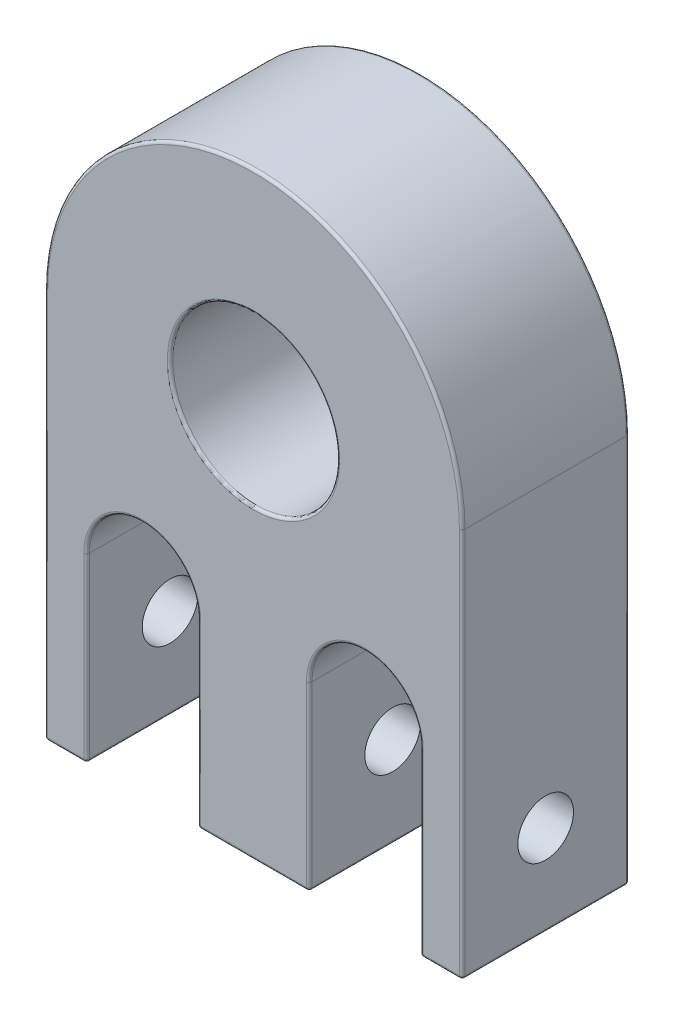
ISO-10303-21;
HEADER;
FILE_DESCRIPTION(('STEP AP214'),'2;1');
FILE_NAME('part.step','',(''),(''),'','','');
FILE_SCHEMA(('AUTOMOTIVE_DESIGN { 1 0 10303 214 1 1 1 1 }'));
ENDSEC;
DATA;
#1=APPLICATION_CONTEXT('core data for automotive mechanical design processes');
#2=APPLICATION_PROTOCOL_DEFINITION('international standard','automotive_design',2000,#1);
#3=PRODUCT_CONTEXT('',#1,'mechanical');
#4=PRODUCT('Part','Part','',(#3));
#5=PRODUCT_RELATED_PRODUCT_CATEGORY('part','',(#4));
#6=PRODUCT_DEFINITION_FORMATION('','',#4);
#7=PRODUCT_DEFINITION_CONTEXT('part definition',#1,'design');
#8=PRODUCT_DEFINITION('design','',#6,#7);
#9=PRODUCT_DEFINITION_SHAPE('','',#8);
#10=(LENGTH_UNIT() NAMED_UNIT(*) SI_UNIT(.MILLI.,.METRE.));
#11=(NAMED_UNIT(*) PLANE_ANGLE_UNIT() SI_UNIT($,.RADIAN.));
#12=(NAMED_UNIT(*) SI_UNIT($,.STERADIAN.) SOLID_ANGLE_UNIT());
#13=UNCERTAINTY_MEASURE_WITH_UNIT(LENGTH_MEASURE(1.E-05),#10,'distance_accuracy_value','');
#14=(GEOMETRIC_REPRESENTATION_CONTEXT(3) GLOBAL_UNCERTAINTY_ASSIGNED_CONTEXT((#13)) GLOBAL_UNIT_ASSIGNED_CONTEXT((#10,
#11,#12)) REPRESENTATION_CONTEXT('',''));
#15=CARTESIAN_POINT('',(0.,0.,0.));
#16=DIRECTION('',(0.,0.,1.));
#17=DIRECTION('',(1.,0.,0.));
#18=AXIS2_PLACEMENT_3D('',#15,#16,#17);
#19=CARTESIAN_POINT('',(7.,13.,12.));
#20=DIRECTION('',(0.,0.,-1.));
#21=DIRECTION('',(-1.,0.,0.));
#22=AXIS2_PLACEMENT_3D('',#19,#20,#21);
#23=PLANE('',#22);
#24=CARTESIAN_POINT('',(15.,28.,12.));
#25=DIRECTION('',(0.,0.,-1.));
#26=DIRECTION('',(-1.,0.,0.));
#27=AXIS2_PLACEMENT_3D('',#24,#25,#26);
#28=CIRCLE('',#27,6.2);
#29=CARTESIAN_POINT('',(8.8,28.,12.));
#30=VERTEX_POINT('',#29);
#31=EDGE_CURVE('E11',#30,#30,#28,.T.);
#32=ORIENTED_EDGE('',*,*,#31,.T.);
#33=EDGE_LOOP('',(#32));
#34=FACE_BOUND('',#33,.T.);
#35=CARTESIAN_POINT('',(15.,28.,12.));
#36=DIRECTION('',(0.,0.,-1.));
#37=DIRECTION('',(-1.,0.,0.));
#38=AXIS2_PLACEMENT_3D('',#35,#36,#37);
#39=CIRCLE('',#38,14.8);
#40=CARTESIAN_POINT('',(29.8,28.,12.));
#41=VERTEX_POINT('',#40);
#42=CARTESIAN_POINT('',(0.2,28.,12.));
#43=VERTEX_POINT('',#42);
#44=EDGE_CURVE('E46',#41,#43,#39,.F.);
#45=ORIENTED_EDGE('',*,*,#44,.T.);
#46=DIRECTION('',(0.,-1.,0.));
#47=VECTOR('',#46,1.);
#48=CARTESIAN_POINT('',(0.2,13.,12.));
#49=LINE('',#48,#47);
#50=CARTESIAN_POINT('',(0.2,0.200000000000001,12.));
#51=VERTEX_POINT('',#50);
#52=EDGE_CURVE('E39',#43,#51,#49,.T.);
#53=ORIENTED_EDGE('',*,*,#52,.T.);
#54=DIRECTION('',(1.,0.,0.));
#55=VECTOR('',#54,1.);
#56=CARTESIAN_POINT('',(7.,0.200000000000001,12.));
#57=LINE('',#56,#55);
#58=CARTESIAN_POINT('',(2.8,0.200000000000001,12.));
#59=VERTEX_POINT('',#58);
#60=EDGE_CURVE('E375',#51,#59,#57,.T.);
#61=ORIENTED_EDGE('',*,*,#60,.T.);
#62=DIRECTION('',(0.,1.,0.));
#63=VECTOR('',#62,1.);
#64=CARTESIAN_POINT('',(2.8,13.,12.));
#65=LINE('',#64,#63);
#66=CARTESIAN_POINT('',(2.8,13.,12.));
#67=VERTEX_POINT('',#66);
#68=EDGE_CURVE('E377',#59,#67,#65,.T.);
#69=ORIENTED_EDGE('',*,*,#68,.T.);
#70=CARTESIAN_POINT('',(7.,13.,12.));
#71=DIRECTION('',(0.,0.,-1.));
#72=DIRECTION('',(-1.,0.,0.));
#73=AXIS2_PLACEMENT_3D('',#70,#71,#72);
#74=CIRCLE('',#73,4.2);
#75=CARTESIAN_POINT('',(11.2,13.,12.));
#76=VERTEX_POINT('',#75);
#77=EDGE_CURVE('E379',#67,#76,#74,.T.);
#78=ORIENTED_EDGE('',*,*,#77,.T.);
#79=DIRECTION('',(0.,-1.,0.));
#80=VECTOR('',#79,1.);
#81=CARTESIAN_POINT('',(11.2,13.,12.));
#82=LINE('',#81,#80);
#83=CARTESIAN_POINT('',(11.2,0.200000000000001,12.));
#84=VERTEX_POINT('',#83);
#85=EDGE_CURVE('E381',#76,#84,#82,.T.);
#86=ORIENTED_EDGE('',*,*,#85,.T.);
#87=DIRECTION('',(1.,0.,0.));
#88=VECTOR('',#87,1.);
#89=CARTESIAN_POINT('',(7.,0.200000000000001,12.));
#90=LINE('',#89,#88);
#91=CARTESIAN_POINT('',(18.8,0.200000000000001,12.));
#92=VERTEX_POINT('',#91);
#93=EDGE_CURVE('E383',#84,#92,#90,.T.);
#94=ORIENTED_EDGE('',*,*,#93,.T.);
#95=DIRECTION('',(0.,1.,0.));
#96=VECTOR('',#95,1.);
#97=CARTESIAN_POINT('',(18.8,13.,12.));
#98=LINE('',#97,#96);
#99=CARTESIAN_POINT('',(18.8,13.,12.));
#100=VERTEX_POINT('',#99);
#101=EDGE_CURVE('E385',#92,#100,#98,.T.);
#102=ORIENTED_EDGE('',*,*,#101,.T.);
#103=CARTESIAN_POINT('',(23.,13.,12.));
#104=DIRECTION('',(0.,0.,-1.));
#105=DIRECTION('',(-1.,0.,0.));
#106=AXIS2_PLACEMENT_3D('',#103,#104,#105);
#107=CIRCLE('',#106,4.2);
#108=CARTESIAN_POINT('',(27.2,13.,12.));
#109=VERTEX_POINT('',#108);
#110=EDGE_CURVE('E387',#100,#109,#107,.T.);
#111=ORIENTED_EDGE('',*,*,#110,.T.);
#112=DIRECTION('',(0.,-1.,0.));
#113=VECTOR('',#112,1.);
#114=CARTESIAN_POINT('',(27.2,13.,12.));
#115=LINE('',#114,#113);
#116=CARTESIAN_POINT('',(27.2,0.200000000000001,12.));
#117=VERTEX_POINT('',#116);
#118=EDGE_CURVE('E389',#109,#117,#115,.T.);
#119=ORIENTED_EDGE('',*,*,#118,.T.);
#120=DIRECTION('',(1.,0.,0.));
#121=VECTOR('',#120,1.);
#122=CARTESIAN_POINT('',(7.,0.200000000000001,12.));
#123=LINE('',#122,#121);
#124=CARTESIAN_POINT('',(29.8,0.200000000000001,12.));
#125=VERTEX_POINT('',#124);
#126=EDGE_CURVE('E391',#117,#125,#123,.T.);
#127=ORIENTED_EDGE('',*,*,#126,.T.);
#128=DIRECTION('',(0.,1.,0.));
#129=VECTOR('',#128,1.);
#130=CARTESIAN_POINT('',(29.8,13.,12.));
#131=LINE('',#130,#129);
#132=EDGE_CURVE('E51',#125,#41,#131,.T.);
#133=ORIENTED_EDGE('',*,*,#132,.T.);
#134=EDGE_LOOP('',(#45,#53,#61,#69,#78,#86,#94,#102,#111,#119,#127,#133));
#135=FACE_BOUND('',#134,.T.);
#136=ADVANCED_FACE('F31',(#34,#135),#23,.F.);
#137=CARTESIAN_POINT('',(7.,13.,0.));
#138=DIRECTION('',(0.,0.,-1.));
#139=DIRECTION('',(-1.,0.,0.));
#140=AXIS2_PLACEMENT_3D('',#137,#138,#139);
#141=PLANE('',#140);
#142=CARTESIAN_POINT('',(15.,28.,0.));
#143=DIRECTION('',(0.,0.,-1.));
#144=DIRECTION('',(-1.,0.,0.));
#145=AXIS2_PLACEMENT_3D('',#142,#143,#144);
#146=CIRCLE('',#145,6.2);
#147=CARTESIAN_POINT('',(8.8,28.,0.));
#148=VERTEX_POINT('',#147);
#149=EDGE_CURVE('E354',#148,#148,#146,.F.);
#150=ORIENTED_EDGE('',*,*,#149,.T.);
#151=EDGE_LOOP('',(#150));
#152=FACE_BOUND('',#151,.T.);
#153=CARTESIAN_POINT('',(7.,13.,0.));
#154=DIRECTION('',(0.,0.,-1.));
#155=DIRECTION('',(-1.,0.,0.));
#156=AXIS2_PLACEMENT_3D('',#153,#154,#155);
#157=CIRCLE('',#156,4.2);
#158=CARTESIAN_POINT('',(11.2,13.,0.));
#159=VERTEX_POINT('',#158);
#160=CARTESIAN_POINT('',(2.8,13.,0.));
#161=VERTEX_POINT('',#160);
#162=EDGE_CURVE('E349',#159,#161,#157,.F.);
#163=ORIENTED_EDGE('',*,*,#162,.T.);
#164=DIRECTION('',(0.,1.,0.));
#165=VECTOR('',#164,1.);
#166=CARTESIAN_POINT('',(2.8,0.,0.));
#167=LINE('',#166,#165);
#168=CARTESIAN_POINT('',(2.8,0.2,0.));
#169=VERTEX_POINT('',#168);
#170=EDGE_CURVE('E351',#161,#169,#167,.F.);
#171=ORIENTED_EDGE('',*,*,#170,.T.);
#172=DIRECTION('',(1.,0.,0.));
#173=VECTOR('',#172,1.);
#174=CARTESIAN_POINT('',(0.,0.2,0.));
#175=LINE('',#174,#173);
#176=CARTESIAN_POINT('',(0.2,0.2,0.));
#177=VERTEX_POINT('',#176);
#178=EDGE_CURVE('E329',#169,#177,#175,.F.);
#179=ORIENTED_EDGE('',*,*,#178,.T.);
#180=DIRECTION('',(0.,-1.,0.));
#181=VECTOR('',#180,1.);
#182=CARTESIAN_POINT('',(0.2,28.,0.));
#183=LINE('',#182,#181);
#184=CARTESIAN_POINT('',(0.2,28.,0.));
#185=VERTEX_POINT('',#184);
#186=EDGE_CURVE('E331',#177,#185,#183,.F.);
#187=ORIENTED_EDGE('',*,*,#186,.T.);
#188=CARTESIAN_POINT('',(15.,28.,0.));
#189=DIRECTION('',(0.,0.,-1.));
#190=DIRECTION('',(-1.,0.,0.));
#191=AXIS2_PLACEMENT_3D('',#188,#189,#190);
#192=CIRCLE('',#191,14.8);
#193=CARTESIAN_POINT('',(29.8,28.,0.));
#194=VERTEX_POINT('',#193);
#195=EDGE_CURVE('E333',#185,#194,#192,.T.);
#196=ORIENTED_EDGE('',*,*,#195,.T.);
#197=DIRECTION('',(0.,1.,0.));
#198=VECTOR('',#197,1.);
#199=CARTESIAN_POINT('',(29.8,0.,0.));
#200=LINE('',#199,#198);
#201=CARTESIAN_POINT('',(29.8,0.2,0.));
#202=VERTEX_POINT('',#201);
#203=EDGE_CURVE('E335',#194,#202,#200,.F.);
#204=ORIENTED_EDGE('',*,*,#203,.T.);
#205=DIRECTION('',(1.,0.,0.));
#206=VECTOR('',#205,1.);
#207=CARTESIAN_POINT('',(27.,0.2,0.));
#208=LINE('',#207,#206);
#209=CARTESIAN_POINT('',(27.2,0.2,0.));
#210=VERTEX_POINT('',#209);
#211=EDGE_CURVE('E337',#202,#210,#208,.F.);
#212=ORIENTED_EDGE('',*,*,#211,.T.);
#213=DIRECTION('',(0.,-1.,0.));
#214=VECTOR('',#213,1.);
#215=CARTESIAN_POINT('',(27.2,13.,0.));
#216=LINE('',#215,#214);
#217=CARTESIAN_POINT('',(27.2,13.,0.));
#218=VERTEX_POINT('',#217);
#219=EDGE_CURVE('E339',#210,#218,#216,.F.);
#220=ORIENTED_EDGE('',*,*,#219,.T.);
#221=CARTESIAN_POINT('',(23.,13.,0.));
#222=DIRECTION('',(0.,0.,-1.));
#223=DIRECTION('',(-1.,0.,0.));
#224=AXIS2_PLACEMENT_3D('',#221,#222,#223);
#225=CIRCLE('',#224,4.2);
#226=CARTESIAN_POINT('',(18.8,13.,0.));
#227=VERTEX_POINT('',#226);
#228=EDGE_CURVE('E341',#218,#227,#225,.F.);
#229=ORIENTED_EDGE('',*,*,#228,.T.);
#230=DIRECTION('',(0.,1.,0.));
#231=VECTOR('',#230,1.);
#232=CARTESIAN_POINT('',(18.8,0.,0.));
#233=LINE('',#232,#231);
#234=CARTESIAN_POINT('',(18.8,0.2,0.));
#235=VERTEX_POINT('',#234);
#236=EDGE_CURVE('E343',#227,#235,#233,.F.);
#237=ORIENTED_EDGE('',*,*,#236,.T.);
#238=DIRECTION('',(1.,0.,0.));
#239=VECTOR('',#238,1.);
#240=CARTESIAN_POINT('',(11.,0.2,0.));
#241=LINE('',#240,#239);
#242=CARTESIAN_POINT('',(11.2,0.2,0.));
#243=VERTEX_POINT('',#242);
#244=EDGE_CURVE('E345',#235,#243,#241,.F.);
#245=ORIENTED_EDGE('',*,*,#244,.T.);
#246=DIRECTION('',(0.,-1.,0.));
#247=VECTOR('',#246,1.);
#248=CARTESIAN_POINT('',(11.2,13.,0.));
#249=LINE('',#248,#247);
#250=EDGE_CURVE('E347',#243,#159,#249,.F.);
#251=ORIENTED_EDGE('',*,*,#250,.T.);
#252=EDGE_LOOP('',(#163,#171,#179,#187,#196,#204,#212,#220,#229,#237,#245,#251));
#253=FACE_BOUND('',#252,.T.);
#254=ADVANCED_FACE('F592',(#152,#253),#141,.T.);
#255=CARTESIAN_POINT('',(0.,0.,12.));
#256=DIRECTION('',(0.,1.,0.));
#257=DIRECTION('',(0.,0.,1.));
#258=AXIS2_PLACEMENT_3D('',#255,#256,#257);
#259=PLANE('',#258);
#260=DIRECTION('',(0.,0.,-1.));
#261=VECTOR('',#260,1.);
#262=CARTESIAN_POINT('',(0.2,0.,12.));
#263=LINE('',#262,#261);
#264=CARTESIAN_POINT('',(0.2,0.,11.8));
#265=VERTEX_POINT('',#264);
#266=CARTESIAN_POINT('',(0.2,0.,0.200000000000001));
#267=VERTEX_POINT('',#266);
#268=EDGE_CURVE('E312',#265,#267,#263,.T.);
#269=ORIENTED_EDGE('',*,*,#268,.T.);
#270=DIRECTION('',(1.,0.,0.));
#271=VECTOR('',#270,1.);
#272=CARTESIAN_POINT('',(3.,0.,0.200000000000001));
#273=LINE('',#272,#271);
#274=CARTESIAN_POINT('',(2.8,0.,0.200000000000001));
#275=VERTEX_POINT('',#274);
#276=EDGE_CURVE('E315',#267,#275,#273,.T.);
#277=ORIENTED_EDGE('',*,*,#276,.T.);
#278=DIRECTION('',(0.,0.,-1.));
#279=VECTOR('',#278,1.);
#280=CARTESIAN_POINT('',(2.8,0.,12.));
#281=LINE('',#280,#279);
#282=CARTESIAN_POINT('',(2.8,0.,11.8));
#283=VERTEX_POINT('',#282);
#284=EDGE_CURVE('E310',#275,#283,#281,.F.);
#285=ORIENTED_EDGE('',*,*,#284,.T.);
#286=DIRECTION('',(1.,0.,0.));
#287=VECTOR('',#286,1.);
#288=CARTESIAN_POINT('',(0.,0.,11.8));
#289=LINE('',#288,#287);
#290=EDGE_CURVE('E308',#283,#265,#289,.F.);
#291=ORIENTED_EDGE('',*,*,#290,.T.);
#292=EDGE_LOOP('',(#269,#277,#285,#291));
#293=FACE_BOUND('',#292,.T.);
#294=ADVANCED_FACE('F33',(#293),#259,.F.);
#295=CARTESIAN_POINT('',(3.,0.,12.));
#296=DIRECTION('',(-1.,0.,0.));
#297=DIRECTION('',(0.,0.,1.));
#298=AXIS2_PLACEMENT_3D('',#295,#296,#297);
#299=PLANE('',#298);
#300=CARTESIAN_POINT('',(3.,6.5,6.));
#301=DIRECTION('',(-1.,0.,0.));
#302=DIRECTION('',(0.,0.,1.));
#303=AXIS2_PLACEMENT_3D('',#300,#301,#302);
#304=CIRCLE('',#303,2.);
#305=CARTESIAN_POINT('',(3.,6.5,8.));
#306=VERTEX_POINT('',#305);
#307=EDGE_CURVE('E497',#306,#306,#304,.T.);
#308=ORIENTED_EDGE('',*,*,#307,.T.);
#309=EDGE_LOOP('',(#308));
#310=FACE_BOUND('',#309,.T.);
#311=DIRECTION('',(0.,0.,-1.));
#312=VECTOR('',#311,1.);
#313=CARTESIAN_POINT('',(3.,0.2,12.));
#314=LINE('',#313,#312);
#315=CARTESIAN_POINT('',(3.,0.2,11.8));
#316=VERTEX_POINT('',#315);
#317=CARTESIAN_POINT('',(3.,0.2,0.200000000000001));
#318=VERTEX_POINT('',#317);
#319=EDGE_CURVE('E325',#316,#318,#314,.T.);
#320=ORIENTED_EDGE('',*,*,#319,.T.);
#321=DIRECTION('',(0.,1.,0.));
#322=VECTOR('',#321,1.);
#323=CARTESIAN_POINT('',(3.,13.,0.200000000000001));
#324=LINE('',#323,#322);
#325=CARTESIAN_POINT('',(3.,13.,0.200000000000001));
#326=VERTEX_POINT('',#325);
#327=EDGE_CURVE('E327',#318,#326,#324,.T.);
#328=ORIENTED_EDGE('',*,*,#327,.T.);
#329=DIRECTION('',(0.,0.,-1.));
#330=VECTOR('',#329,1.);
#331=CARTESIAN_POINT('',(3.,13.,12.));
#332=LINE('',#331,#330);
#333=CARTESIAN_POINT('',(3.,13.,11.8));
#334=VERTEX_POINT('',#333);
#335=EDGE_CURVE('E265',#334,#326,#332,.T.);
#336=ORIENTED_EDGE('',*,*,#335,.F.);
#337=DIRECTION('',(0.,1.,0.));
#338=VECTOR('',#337,1.);
#339=CARTESIAN_POINT('',(3.,0.,11.8));
#340=LINE('',#339,#338);
#341=EDGE_CURVE('E323',#334,#316,#340,.F.);
#342=ORIENTED_EDGE('',*,*,#341,.T.);
#343=EDGE_LOOP('',(#320,#328,#336,#342));
#344=FACE_BOUND('',#343,.T.);
#345=ADVANCED_FACE('F636',(#310,#344),#299,.F.);
#346=CARTESIAN_POINT('',(7.,13.,12.));
#347=DIRECTION('',(0.,0.,-1.));
#348=DIRECTION('',(-1.,0.,0.));
#349=AXIS2_PLACEMENT_3D('',#346,#347,#348);
#350=CYLINDRICAL_SURFACE('',#349,4.);
#351=ORIENTED_EDGE('',*,*,#335,.T.);
#352=CARTESIAN_POINT('',(7.,13.,0.200000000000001));
#353=DIRECTION('',(0.,0.,-1.));
#354=DIRECTION('',(-1.,0.,0.));
#355=AXIS2_PLACEMENT_3D('',#352,#353,#354);
#356=CIRCLE('',#355,4.);
#357=CARTESIAN_POINT('',(11.,13.,0.200000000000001));
#358=VERTEX_POINT('',#357);
#359=EDGE_CURVE('E365',#326,#358,#356,.T.);
#360=ORIENTED_EDGE('',*,*,#359,.T.);
#361=DIRECTION('',(0.,0.,-1.));
#362=VECTOR('',#361,1.);
#363=CARTESIAN_POINT('',(11.,13.,12.));
#364=LINE('',#363,#362);
#365=CARTESIAN_POINT('',(11.,13.,11.8));
#366=VERTEX_POINT('',#365);
#367=EDGE_CURVE('E268',#366,#358,#364,.T.);
#368=ORIENTED_EDGE('',*,*,#367,.F.);
#369=CARTESIAN_POINT('',(7.,13.,11.8));
#370=DIRECTION('',(0.,0.,-1.));
#371=DIRECTION('',(-1.,0.,0.));
#372=AXIS2_PLACEMENT_3D('',#369,#370,#371);
#373=CIRCLE('',#372,4.);
#374=EDGE_CURVE('E363',#366,#334,#373,.F.);
#375=ORIENTED_EDGE('',*,*,#374,.T.);
#376=EDGE_LOOP('',(#351,#360,#368,#375));
#377=FACE_BOUND('',#376,.T.);
#378=ADVANCED_FACE('F633',(#377),#350,.F.);
#379=CARTESIAN_POINT('',(11.,0.,12.));
#380=DIRECTION('',(1.,0.,0.));
#381=DIRECTION('',(0.,0.,-1.));
#382=AXIS2_PLACEMENT_3D('',#379,#380,#381);
#383=PLANE('',#382);
#384=CARTESIAN_POINT('',(11.,6.5,6.));
#385=DIRECTION('',(1.,0.,0.));
#386=DIRECTION('',(0.,0.,-1.));
#387=AXIS2_PLACEMENT_3D('',#384,#385,#386);
#388=CIRCLE('',#387,2.);
#389=CARTESIAN_POINT('',(11.,6.5,4.));
#390=VERTEX_POINT('',#389);
#391=EDGE_CURVE('E500',#390,#390,#388,.T.);
#392=ORIENTED_EDGE('',*,*,#391,.T.);
#393=EDGE_LOOP('',(#392));
#394=FACE_BOUND('',#393,.T.);
#395=ORIENTED_EDGE('',*,*,#367,.T.);
#396=DIRECTION('',(0.,-1.,0.));
#397=VECTOR('',#396,1.);
#398=CARTESIAN_POINT('',(11.,0.,0.200000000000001));
#399=LINE('',#398,#397);
#400=CARTESIAN_POINT('',(11.,0.2,0.200000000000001));
#401=VERTEX_POINT('',#400);
#402=EDGE_CURVE('E300',#358,#401,#399,.T.);
#403=ORIENTED_EDGE('',*,*,#402,.T.);
#404=DIRECTION('',(0.,0.,-1.));
#405=VECTOR('',#404,1.);
#406=CARTESIAN_POINT('',(11.,0.2,12.));
#407=LINE('',#406,#405);
#408=CARTESIAN_POINT('',(11.,0.2,11.8));
#409=VERTEX_POINT('',#408);
#410=EDGE_CURVE('E297',#401,#409,#407,.F.);
#411=ORIENTED_EDGE('',*,*,#410,.T.);
#412=DIRECTION('',(0.,-1.,0.));
#413=VECTOR('',#412,1.);
#414=CARTESIAN_POINT('',(11.,0.,11.8));
#415=LINE('',#414,#413);
#416=EDGE_CURVE('E295',#409,#366,#415,.F.);
#417=ORIENTED_EDGE('',*,*,#416,.T.);
#418=EDGE_LOOP('',(#395,#403,#411,#417));
#419=FACE_BOUND('',#418,.T.);
#420=ADVANCED_FACE('F518',(#394,#419),#383,.F.);
#421=CARTESIAN_POINT('',(11.,0.,12.));
#422=DIRECTION('',(0.,1.,0.));
#423=DIRECTION('',(0.,0.,1.));
#424=AXIS2_PLACEMENT_3D('',#421,#422,#423);
#425=PLANE('',#424);
#426=DIRECTION('',(0.,0.,-1.));
#427=VECTOR('',#426,1.);
#428=CARTESIAN_POINT('',(11.2,0.,12.));
#429=LINE('',#428,#427);
#430=CARTESIAN_POINT('',(11.2,0.,11.8));
#431=VERTEX_POINT('',#430);
#432=CARTESIAN_POINT('',(11.2,0.,0.200000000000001));
#433=VERTEX_POINT('',#432);
#434=EDGE_CURVE('E290',#431,#433,#429,.T.);
#435=ORIENTED_EDGE('',*,*,#434,.T.);
#436=DIRECTION('',(1.,0.,0.));
#437=VECTOR('',#436,1.);
#438=CARTESIAN_POINT('',(19.,0.,0.200000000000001));
#439=LINE('',#438,#437);
#440=CARTESIAN_POINT('',(18.8,0.,0.200000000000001));
#441=VERTEX_POINT('',#440);
#442=EDGE_CURVE('E293',#433,#441,#439,.T.);
#443=ORIENTED_EDGE('',*,*,#442,.T.);
#444=DIRECTION('',(0.,0.,-1.));
#445=VECTOR('',#444,1.);
#446=CARTESIAN_POINT('',(18.8,0.,12.));
#447=LINE('',#446,#445);
#448=CARTESIAN_POINT('',(18.8,0.,11.8));
#449=VERTEX_POINT('',#448);
#450=EDGE_CURVE('E288',#441,#449,#447,.F.);
#451=ORIENTED_EDGE('',*,*,#450,.T.);
#452=DIRECTION('',(1.,0.,0.));
#453=VECTOR('',#452,1.);
#454=CARTESIAN_POINT('',(11.,0.,11.8));
#455=LINE('',#454,#453);
#456=EDGE_CURVE('E286',#449,#431,#455,.F.);
#457=ORIENTED_EDGE('',*,*,#456,.T.);
#458=EDGE_LOOP('',(#435,#443,#451,#457));
#459=FACE_BOUND('',#458,.T.);
#460=ADVANCED_FACE('F541',(#459),#425,.F.);
#461=CARTESIAN_POINT('',(19.,0.,12.));
#462=DIRECTION('',(-1.,0.,0.));
#463=DIRECTION('',(0.,-1.,0.));
#464=AXIS2_PLACEMENT_3D('',#461,#462,#463);
#465=PLANE('',#464);
#466=CARTESIAN_POINT('',(19.,6.5,6.));
#467=DIRECTION('',(-1.,0.,0.));
#468=DIRECTION('',(0.,-1.,0.));
#469=AXIS2_PLACEMENT_3D('',#466,#467,#468);
#470=CIRCLE('',#469,2.);
#471=CARTESIAN_POINT('',(19.,4.5,6.));
#472=VERTEX_POINT('',#471);
#473=EDGE_CURVE('E494',#472,#472,#470,.T.);
#474=ORIENTED_EDGE('',*,*,#473,.T.);
#475=EDGE_LOOP('',(#474));
#476=FACE_BOUND('',#475,.T.);
#477=DIRECTION('',(0.,0.,-1.));
#478=VECTOR('',#477,1.);
#479=CARTESIAN_POINT('',(19.,0.2,12.));
#480=LINE('',#479,#478);
#481=CARTESIAN_POINT('',(19.,0.2,11.8));
#482=VERTEX_POINT('',#481);
#483=CARTESIAN_POINT('',(19.,0.2,0.200000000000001));
#484=VERTEX_POINT('',#483);
#485=EDGE_CURVE('E304',#482,#484,#480,.T.);
#486=ORIENTED_EDGE('',*,*,#485,.T.);
#487=DIRECTION('',(0.,1.,0.));
#488=VECTOR('',#487,1.);
#489=CARTESIAN_POINT('',(19.,13.,0.200000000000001));
#490=LINE('',#489,#488);
#491=CARTESIAN_POINT('',(19.,13.,0.200000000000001));
#492=VERTEX_POINT('',#491);
#493=EDGE_CURVE('E306',#484,#492,#490,.T.);
#494=ORIENTED_EDGE('',*,*,#493,.T.);
#495=DIRECTION('',(0.,0.,-1.));
#496=VECTOR('',#495,1.);
#497=CARTESIAN_POINT('',(19.,13.,12.));
#498=LINE('',#497,#496);
#499=CARTESIAN_POINT('',(19.,13.,11.8));
#500=VERTEX_POINT('',#499);
#501=EDGE_CURVE('E512',#500,#492,#498,.T.);
#502=ORIENTED_EDGE('',*,*,#501,.F.);
#503=DIRECTION('',(0.,1.,0.));
#504=VECTOR('',#503,1.);
#505=CARTESIAN_POINT('',(19.,0.,11.8));
#506=LINE('',#505,#504);
#507=EDGE_CURVE('E302',#500,#482,#506,.F.);
#508=ORIENTED_EDGE('',*,*,#507,.T.);
#509=EDGE_LOOP('',(#486,#494,#502,#508));
#510=FACE_BOUND('',#509,.T.);
#511=ADVANCED_FACE('F624',(#476,#510),#465,.F.);
#512=CARTESIAN_POINT('',(23.,13.,12.));
#513=DIRECTION('',(0.,0.,-1.));
#514=DIRECTION('',(-1.,0.,0.));
#515=AXIS2_PLACEMENT_3D('',#512,#513,#514);
#516=CYLINDRICAL_SURFACE('',#515,4.);
#517=ORIENTED_EDGE('',*,*,#501,.T.);
#518=CARTESIAN_POINT('',(23.,13.,0.200000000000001));
#519=DIRECTION('',(0.,0.,-1.));
#520=DIRECTION('',(-1.,0.,0.));
#521=AXIS2_PLACEMENT_3D('',#518,#519,#520);
#522=CIRCLE('',#521,4.);
#523=CARTESIAN_POINT('',(27.,13.,0.200000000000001));
#524=VERTEX_POINT('',#523);
#525=EDGE_CURVE('E369',#492,#524,#522,.T.);
#526=ORIENTED_EDGE('',*,*,#525,.T.);
#527=DIRECTION('',(0.,0.,-1.));
#528=VECTOR('',#527,1.);
#529=CARTESIAN_POINT('',(27.,13.,12.));
#530=LINE('',#529,#528);
#531=CARTESIAN_POINT('',(27.,13.,11.8));
#532=VERTEX_POINT('',#531);
#533=EDGE_CURVE('E509',#532,#524,#530,.T.);
#534=ORIENTED_EDGE('',*,*,#533,.F.);
#535=CARTESIAN_POINT('',(23.,13.,11.8));
#536=DIRECTION('',(0.,0.,-1.));
#537=DIRECTION('',(-1.,0.,0.));
#538=AXIS2_PLACEMENT_3D('',#535,#536,#537);
#539=CIRCLE('',#538,4.);
#540=EDGE_CURVE('E367',#532,#500,#539,.F.);
#541=ORIENTED_EDGE('',*,*,#540,.T.);
#542=EDGE_LOOP('',(#517,#526,#534,#541));
#543=FACE_BOUND('',#542,.T.);
#544=ADVANCED_FACE('F620',(#543),#516,.F.);
#545=CARTESIAN_POINT('',(27.,0.,12.));
#546=DIRECTION('',(1.,0.,0.));
#547=DIRECTION('',(0.,1.,0.));
#548=AXIS2_PLACEMENT_3D('',#545,#546,#547);
#549=PLANE('',#548);
#550=CARTESIAN_POINT('',(27.,6.5,6.));
#551=DIRECTION('',(1.,0.,0.));
#552=DIRECTION('',(0.,1.,0.));
#553=AXIS2_PLACEMENT_3D('',#550,#551,#552);
#554=CIRCLE('',#553,2.);
#555=CARTESIAN_POINT('',(27.,8.5,6.));
#556=VERTEX_POINT('',#555);
#557=EDGE_CURVE('E491',#556,#556,#554,.T.);
#558=ORIENTED_EDGE('',*,*,#557,.T.);
#559=EDGE_LOOP('',(#558));
#560=FACE_BOUND('',#559,.T.);
#561=ORIENTED_EDGE('',*,*,#533,.T.);
#562=DIRECTION('',(0.,-1.,0.));
#563=VECTOR('',#562,1.);
#564=CARTESIAN_POINT('',(27.,0.,0.200000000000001));
#565=LINE('',#564,#563);
#566=CARTESIAN_POINT('',(27.,0.2,0.200000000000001));
#567=VERTEX_POINT('',#566);
#568=EDGE_CURVE('E279',#524,#567,#565,.T.);
#569=ORIENTED_EDGE('',*,*,#568,.T.);
#570=DIRECTION('',(0.,0.,-1.));
#571=VECTOR('',#570,1.);
#572=CARTESIAN_POINT('',(27.,0.2,12.));
#573=LINE('',#572,#571);
#574=CARTESIAN_POINT('',(27.,0.2,11.8));
#575=VERTEX_POINT('',#574);
#576=EDGE_CURVE('E276',#567,#575,#573,.F.);
#577=ORIENTED_EDGE('',*,*,#576,.T.);
#578=DIRECTION('',(0.,-1.,0.));
#579=VECTOR('',#578,1.);
#580=CARTESIAN_POINT('',(27.,0.,11.8));
#581=LINE('',#580,#579);
#582=EDGE_CURVE('E274',#575,#532,#581,.F.);
#583=ORIENTED_EDGE('',*,*,#582,.T.);
#584=EDGE_LOOP('',(#561,#569,#577,#583));
#585=FACE_BOUND('',#584,.T.);
#586=ADVANCED_FACE('F617',(#560,#585),#549,.F.);
#587=CARTESIAN_POINT('',(27.,0.,12.));
#588=DIRECTION('',(0.,1.,0.));
#589=DIRECTION('',(0.,0.,1.));
#590=AXIS2_PLACEMENT_3D('',#587,#588,#589);
#591=PLANE('',#590);
#592=DIRECTION('',(0.,0.,-1.));
#593=VECTOR('',#592,1.);
#594=CARTESIAN_POINT('',(27.2,0.,12.));
#595=LINE('',#594,#593);
#596=CARTESIAN_POINT('',(27.2,0.,11.8));
#597=VERTEX_POINT('',#596);
#598=CARTESIAN_POINT('',(27.2,0.,0.200000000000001));
#599=VERTEX_POINT('',#598);
#600=EDGE_CURVE('E238',#597,#599,#595,.T.);
#601=ORIENTED_EDGE('',*,*,#600,.T.);
#602=DIRECTION('',(1.,0.,0.));
#603=VECTOR('',#602,1.);
#604=CARTESIAN_POINT('',(30.,0.,0.200000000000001));
#605=LINE('',#604,#603);
#606=CARTESIAN_POINT('',(29.8,0.,0.200000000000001));
#607=VERTEX_POINT('',#606);
#608=EDGE_CURVE('E234',#599,#607,#605,.T.);
#609=ORIENTED_EDGE('',*,*,#608,.T.);
#610=DIRECTION('',(0.,0.,-1.));
#611=VECTOR('',#610,1.);
#612=CARTESIAN_POINT('',(29.8,0.,12.));
#613=LINE('',#612,#611);
#614=CARTESIAN_POINT('',(29.8,0.,11.8));
#615=VERTEX_POINT('',#614);
#616=EDGE_CURVE('E226',#607,#615,#613,.F.);
#617=ORIENTED_EDGE('',*,*,#616,.T.);
#618=DIRECTION('',(1.,0.,0.));
#619=VECTOR('',#618,1.);
#620=CARTESIAN_POINT('',(27.,0.,11.8));
#621=LINE('',#620,#619);
#622=EDGE_CURVE('E231',#615,#597,#621,.F.);
#623=ORIENTED_EDGE('',*,*,#622,.T.);
#624=EDGE_LOOP('',(#601,#609,#617,#623));
#625=FACE_BOUND('',#624,.T.);
#626=ADVANCED_FACE('F229',(#625),#591,.F.);
#627=CARTESIAN_POINT('',(30.,0.,12.));
#628=DIRECTION('',(-1.,0.,0.));
#629=DIRECTION('',(0.,0.,1.));
#630=AXIS2_PLACEMENT_3D('',#627,#628,#629);
#631=PLANE('',#630);
#632=CARTESIAN_POINT('',(30.,6.5,6.));
#633=DIRECTION('',(1.,0.,0.));
#634=DIRECTION('',(0.,0.,-1.));
#635=AXIS2_PLACEMENT_3D('',#632,#633,#634);
#636=CIRCLE('',#635,2.);
#637=CARTESIAN_POINT('',(30.,6.5,4.));
#638=VERTEX_POINT('',#637);
#639=EDGE_CURVE('E485',#638,#638,#636,.T.);
#640=ORIENTED_EDGE('',*,*,#639,.F.);
#641=EDGE_LOOP('',(#640));
#642=FACE_BOUND('',#641,.T.);
#643=DIRECTION('',(0.,0.,-1.));
#644=VECTOR('',#643,1.);
#645=CARTESIAN_POINT('',(30.,0.2,12.));
#646=LINE('',#645,#644);
#647=CARTESIAN_POINT('',(30.,0.2,11.8));
#648=VERTEX_POINT('',#647);
#649=CARTESIAN_POINT('',(30.,0.2,0.200000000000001));
#650=VERTEX_POINT('',#649);
#651=EDGE_CURVE('E246',#648,#650,#646,.T.);
#652=ORIENTED_EDGE('',*,*,#651,.T.);
#653=DIRECTION('',(0.,1.,0.));
#654=VECTOR('',#653,1.);
#655=CARTESIAN_POINT('',(30.,28.,0.200000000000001));
#656=LINE('',#655,#654);
#657=CARTESIAN_POINT('',(30.,28.,0.200000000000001));
#658=VERTEX_POINT('',#657);
#659=EDGE_CURVE('E284',#650,#658,#656,.T.);
#660=ORIENTED_EDGE('',*,*,#659,.T.);
#661=DIRECTION('',(0.,0.,-1.));
#662=VECTOR('',#661,1.);
#663=CARTESIAN_POINT('',(30.,28.,12.));
#664=LINE('',#663,#662);
#665=CARTESIAN_POINT('',(30.,28.,11.8));
#666=VERTEX_POINT('',#665);
#667=EDGE_CURVE('E506',#666,#658,#664,.T.);
#668=ORIENTED_EDGE('',*,*,#667,.F.);
#669=DIRECTION('',(0.,1.,0.));
#670=VECTOR('',#669,1.);
#671=CARTESIAN_POINT('',(30.,0.,11.8));
#672=LINE('',#671,#670);
#673=EDGE_CURVE('E281',#666,#648,#672,.F.);
#674=ORIENTED_EDGE('',*,*,#673,.T.);
#675=EDGE_LOOP('',(#652,#660,#668,#674));
#676=FACE_BOUND('',#675,.T.);
#677=ADVANCED_FACE('F610',(#642,#676),#631,.F.);
#678=CARTESIAN_POINT('',(15.,28.,12.));
#679=DIRECTION('',(0.,0.,-1.));
#680=DIRECTION('',(-1.,0.,0.));
#681=AXIS2_PLACEMENT_3D('',#678,#679,#680);
#682=CYLINDRICAL_SURFACE('',#681,15.);
#683=ORIENTED_EDGE('',*,*,#667,.T.);
#684=CARTESIAN_POINT('',(15.,28.,0.200000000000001));
#685=DIRECTION('',(0.,0.,-1.));
#686=DIRECTION('',(-1.,0.,0.));
#687=AXIS2_PLACEMENT_3D('',#684,#685,#686);
#688=CIRCLE('',#687,15.);
#689=CARTESIAN_POINT('',(0.,28.,0.200000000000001));
#690=VERTEX_POINT('',#689);
#691=EDGE_CURVE('E373',#658,#690,#688,.F.);
#692=ORIENTED_EDGE('',*,*,#691,.T.);
#693=DIRECTION('',(0.,0.,-1.));
#694=VECTOR('',#693,1.);
#695=CARTESIAN_POINT('',(0.,28.,12.));
#696=LINE('',#695,#694);
#697=CARTESIAN_POINT('',(0.,28.,11.8));
#698=VERTEX_POINT('',#697);
#699=EDGE_CURVE('E503',#698,#690,#696,.T.);
#700=ORIENTED_EDGE('',*,*,#699,.F.);
#701=CARTESIAN_POINT('',(15.,28.,11.8));
#702=DIRECTION('',(0.,0.,-1.));
#703=DIRECTION('',(-1.,0.,0.));
#704=AXIS2_PLACEMENT_3D('',#701,#702,#703);
#705=CIRCLE('',#704,15.);
#706=EDGE_CURVE('E371',#698,#666,#705,.T.);
#707=ORIENTED_EDGE('',*,*,#706,.T.);
#708=EDGE_LOOP('',(#683,#692,#700,#707));
#709=FACE_BOUND('',#708,.T.);
#710=ADVANCED_FACE('F606',(#709),#682,.T.);
#711=CARTESIAN_POINT('',(0.,0.,12.));
#712=DIRECTION('',(1.,0.,0.));
#713=DIRECTION('',(0.,0.,-1.));
#714=AXIS2_PLACEMENT_3D('',#711,#712,#713);
#715=PLANE('',#714);
#716=CARTESIAN_POINT('',(0.,6.5,6.));
#717=DIRECTION('',(1.,0.,0.));
#718=DIRECTION('',(0.,0.,-1.));
#719=AXIS2_PLACEMENT_3D('',#716,#717,#718);
#720=CIRCLE('',#719,2.);
#721=CARTESIAN_POINT('',(0.,6.5,4.));
#722=VERTEX_POINT('',#721);
#723=EDGE_CURVE('E488',#722,#722,#720,.T.);
#724=ORIENTED_EDGE('',*,*,#723,.T.);
#725=EDGE_LOOP('',(#724));
#726=FACE_BOUND('',#725,.T.);
#727=ORIENTED_EDGE('',*,*,#699,.T.);
#728=DIRECTION('',(0.,-1.,0.));
#729=VECTOR('',#728,1.);
#730=CARTESIAN_POINT('',(0.,0.,0.200000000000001));
#731=LINE('',#730,#729);
#732=CARTESIAN_POINT('',(0.,0.2,0.200000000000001));
#733=VERTEX_POINT('',#732);
#734=EDGE_CURVE('E321',#690,#733,#731,.T.);
#735=ORIENTED_EDGE('',*,*,#734,.T.);
#736=DIRECTION('',(0.,0.,-1.));
#737=VECTOR('',#736,1.);
#738=CARTESIAN_POINT('',(0.,0.2,12.));
#739=LINE('',#738,#737);
#740=CARTESIAN_POINT('',(0.,0.2,11.8));
#741=VERTEX_POINT('',#740);
#742=EDGE_CURVE('E319',#733,#741,#739,.F.);
#743=ORIENTED_EDGE('',*,*,#742,.T.);
#744=DIRECTION('',(0.,-1.,0.));
#745=VECTOR('',#744,1.);
#746=CARTESIAN_POINT('',(0.,0.,11.8));
#747=LINE('',#746,#745);
#748=EDGE_CURVE('E317',#741,#698,#747,.F.);
#749=ORIENTED_EDGE('',*,*,#748,.T.);
#750=EDGE_LOOP('',(#727,#735,#743,#749));
#751=FACE_BOUND('',#750,.T.);
#752=ADVANCED_FACE('F602',(#726,#751),#715,.F.);
#753=CARTESIAN_POINT('',(15.,28.,12.));
#754=DIRECTION('',(0.,0.,-1.));
#755=DIRECTION('',(-1.,0.,0.));
#756=AXIS2_PLACEMENT_3D('',#753,#754,#755);
#757=CYLINDRICAL_SURFACE('',#756,6.);
#758=CARTESIAN_POINT('',(15.,28.,0.200000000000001));
#759=DIRECTION('',(0.,0.,-1.));
#760=DIRECTION('',(-1.,0.,0.));
#761=AXIS2_PLACEMENT_3D('',#758,#759,#760);
#762=CIRCLE('',#761,6.);
#763=CARTESIAN_POINT('',(9.,28.,0.200000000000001));
#764=VERTEX_POINT('',#763);
#765=EDGE_CURVE('E360',#764,#764,#762,.T.);
#766=ORIENTED_EDGE('',*,*,#765,.T.);
#767=EDGE_LOOP('',(#766));
#768=FACE_BOUND('',#767,.T.);
#769=CARTESIAN_POINT('',(15.,28.,11.8));
#770=DIRECTION('',(0.,0.,-1.));
#771=DIRECTION('',(-1.,0.,0.));
#772=AXIS2_PLACEMENT_3D('',#769,#770,#771);
#773=CIRCLE('',#772,6.);
#774=CARTESIAN_POINT('',(9.,28.,11.8));
#775=VERTEX_POINT('',#774);
#776=EDGE_CURVE('E357',#775,#775,#773,.F.);
#777=ORIENTED_EDGE('',*,*,#776,.T.);
#778=EDGE_LOOP('',(#777));
#779=FACE_BOUND('',#778,.T.);
#780=ADVANCED_FACE('F605',(#768,#779),#757,.F.);
#781=CARTESIAN_POINT('',(0.,6.5,6.));
#782=DIRECTION('',(1.,0.,0.));
#783=DIRECTION('',(0.,0.,-1.));
#784=AXIS2_PLACEMENT_3D('',#781,#782,#783);
#785=CYLINDRICAL_SURFACE('',#784,2.);
#786=ORIENTED_EDGE('',*,*,#723,.F.);
#787=EDGE_LOOP('',(#786));
#788=FACE_BOUND('',#787,.T.);
#789=ORIENTED_EDGE('',*,*,#307,.F.);
#790=EDGE_LOOP('',(#789));
#791=FACE_BOUND('',#790,.T.);
#792=ADVANCED_FACE('F846',(#788,#791),#785,.F.);
#793=ORIENTED_EDGE('',*,*,#639,.T.);
#794=EDGE_LOOP('',(#793));
#795=FACE_BOUND('',#794,.T.);
#796=ORIENTED_EDGE('',*,*,#557,.F.);
#797=EDGE_LOOP('',(#796));
#798=FACE_BOUND('',#797,.T.);
#799=ADVANCED_FACE('F844',(#795,#798),#785,.F.);
#800=ORIENTED_EDGE('',*,*,#473,.F.);
#801=EDGE_LOOP('',(#800));
#802=FACE_BOUND('',#801,.T.);
#803=ORIENTED_EDGE('',*,*,#391,.F.);
#804=EDGE_LOOP('',(#803));
#805=FACE_BOUND('',#804,.T.);
#806=ADVANCED_FACE('F842',(#802,#805),#785,.F.);
#807=CARTESIAN_POINT('',(2.8,13.,11.8));
#808=DIRECTION('',(0.,1.,0.));
#809=DIRECTION('',(0.,0.,1.));
#810=AXIS2_PLACEMENT_3D('',#807,#808,#809);
#811=CYLINDRICAL_SURFACE('',#810,0.2);
#812=CARTESIAN_POINT('',(2.8,0.2,11.8));
#813=DIRECTION('',(0.,-1.,0.));
#814=DIRECTION('',(0.,0.,-1.));
#815=AXIS2_PLACEMENT_3D('',#812,#813,#814);
#816=CIRCLE('',#815,0.2);
#817=EDGE_CURVE('E479',#316,#59,#816,.T.);
#818=ORIENTED_EDGE('',*,*,#817,.F.);
#819=ORIENTED_EDGE('',*,*,#341,.F.);
#820=CARTESIAN_POINT('',(2.8,13.,11.8));
#821=DIRECTION('',(0.,1.,0.));
#822=DIRECTION('',(0.,0.,1.));
#823=AXIS2_PLACEMENT_3D('',#820,#821,#822);
#824=CIRCLE('',#823,0.2);
#825=EDGE_CURVE('E482',#67,#334,#824,.T.);
#826=ORIENTED_EDGE('',*,*,#825,.F.);
#827=ORIENTED_EDGE('',*,*,#68,.F.);
#828=EDGE_LOOP('',(#818,#819,#826,#827));
#829=FACE_BOUND('',#828,.T.);
#830=ADVANCED_FACE('F824',(#829),#811,.T.);
#831=CARTESIAN_POINT('',(2.8,0.2,12.));
#832=DIRECTION('',(0.,0.,-1.));
#833=DIRECTION('',(-1.,0.,0.));
#834=AXIS2_PLACEMENT_3D('',#831,#832,#833);
#835=CYLINDRICAL_SURFACE('',#834,0.2);
#836=CARTESIAN_POINT('',(2.8,0.2,0.200000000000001));
#837=DIRECTION('',(0.,0.,-1.));
#838=DIRECTION('',(-1.,0.,0.));
#839=AXIS2_PLACEMENT_3D('',#836,#837,#838);
#840=CIRCLE('',#839,0.2);
#841=EDGE_CURVE('E473',#318,#275,#840,.T.);
#842=ORIENTED_EDGE('',*,*,#841,.F.);
#843=ORIENTED_EDGE('',*,*,#319,.F.);
#844=CARTESIAN_POINT('',(2.8,0.2,11.8));
#845=DIRECTION('',(0.,0.,1.));
#846=DIRECTION('',(1.,0.,0.));
#847=AXIS2_PLACEMENT_3D('',#844,#845,#846);
#848=CIRCLE('',#847,0.2);
#849=EDGE_CURVE('E476',#283,#316,#848,.T.);
#850=ORIENTED_EDGE('',*,*,#849,.F.);
#851=ORIENTED_EDGE('',*,*,#284,.F.);
#852=EDGE_LOOP('',(#842,#843,#850,#851));
#853=FACE_BOUND('',#852,.T.);
#854=ADVANCED_FACE('F659',(#853),#835,.T.);
#855=CARTESIAN_POINT('',(2.8,0.,0.200000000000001));
#856=DIRECTION('',(0.,-1.,0.));
#857=DIRECTION('',(0.,0.,-1.));
#858=AXIS2_PLACEMENT_3D('',#855,#856,#857);
#859=CYLINDRICAL_SURFACE('',#858,0.2);
#860=CARTESIAN_POINT('',(2.8,13.,0.200000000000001));
#861=DIRECTION('',(0.,1.,0.));
#862=DIRECTION('',(0.,0.,1.));
#863=AXIS2_PLACEMENT_3D('',#860,#861,#862);
#864=CIRCLE('',#863,0.2);
#865=EDGE_CURVE('E467',#326,#161,#864,.T.);
#866=ORIENTED_EDGE('',*,*,#865,.F.);
#867=ORIENTED_EDGE('',*,*,#327,.F.);
#868=CARTESIAN_POINT('',(2.8,0.2,0.2));
#869=DIRECTION('',(0.,-1.,0.));
#870=DIRECTION('',(0.,0.,-1.));
#871=AXIS2_PLACEMENT_3D('',#868,#869,#870);
#872=CIRCLE('',#871,0.2);
#873=EDGE_CURVE('E470',#169,#318,#872,.T.);
#874=ORIENTED_EDGE('',*,*,#873,.F.);
#875=ORIENTED_EDGE('',*,*,#170,.F.);
#876=EDGE_LOOP('',(#866,#867,#874,#875));
#877=FACE_BOUND('',#876,.T.);
#878=ADVANCED_FACE('F656',(#877),#859,.T.);
#879=CARTESIAN_POINT('',(7.,13.,11.8));
#880=DIRECTION('',(0.,0.,-1.));
#881=DIRECTION('',(-1.,0.,0.));
#882=AXIS2_PLACEMENT_3D('',#879,#880,#881);
#883=TOROIDAL_SURFACE('',#882,4.2,0.2);
#884=ORIENTED_EDGE('',*,*,#825,.T.);
#885=ORIENTED_EDGE('',*,*,#374,.F.);
#886=CARTESIAN_POINT('',(11.2,13.,11.8));
#887=DIRECTION('',(0.,-1.,0.));
#888=DIRECTION('',(0.,0.,-1.));
#889=AXIS2_PLACEMENT_3D('',#886,#887,#888);
#890=CIRCLE('',#889,0.2);
#891=EDGE_CURVE('E464',#76,#366,#890,.T.);
#892=ORIENTED_EDGE('',*,*,#891,.F.);
#893=ORIENTED_EDGE('',*,*,#77,.F.);
#894=EDGE_LOOP('',(#884,#885,#892,#893));
#895=FACE_BOUND('',#894,.T.);
#896=ADVANCED_FACE('F827',(#895),#883,.T.);
#897=CARTESIAN_POINT('',(2.8,0.2,11.8));
#898=DIRECTION('',(0.,0.,1.));
#899=DIRECTION('',(1.,0.,0.));
#900=AXIS2_PLACEMENT_3D('',#897,#898,#899);
#901=SPHERICAL_SURFACE('',#900,0.2);
#902=ORIENTED_EDGE('',*,*,#849,.T.);
#903=ORIENTED_EDGE('',*,*,#817,.T.);
#904=CARTESIAN_POINT('',(2.8,0.200000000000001,11.8));
#905=DIRECTION('',(1.,0.,0.));
#906=DIRECTION('',(0.,1.,0.));
#907=AXIS2_PLACEMENT_3D('',#904,#905,#906);
#908=CIRCLE('',#907,0.2);
#909=EDGE_CURVE('E461',#283,#59,#908,.F.);
#910=ORIENTED_EDGE('',*,*,#909,.F.);
#911=EDGE_LOOP('',(#902,#903,#910));
#912=FACE_BOUND('',#911,.T.);
#913=ADVANCED_FACE('F822',(#912),#901,.T.);
#914=CARTESIAN_POINT('',(2.8,0.2,0.2));
#915=DIRECTION('',(0.,0.,1.));
#916=DIRECTION('',(1.,0.,0.));
#917=AXIS2_PLACEMENT_3D('',#914,#915,#916);
#918=SPHERICAL_SURFACE('',#917,0.2);
#919=ORIENTED_EDGE('',*,*,#873,.T.);
#920=ORIENTED_EDGE('',*,*,#841,.T.);
#921=CARTESIAN_POINT('',(2.8,0.2,0.200000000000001));
#922=DIRECTION('',(1.,0.,0.));
#923=DIRECTION('',(0.,0.,-1.));
#924=AXIS2_PLACEMENT_3D('',#921,#922,#923);
#925=CIRCLE('',#924,0.2);
#926=EDGE_CURVE('E458',#169,#275,#925,.F.);
#927=ORIENTED_EDGE('',*,*,#926,.F.);
#928=EDGE_LOOP('',(#919,#920,#927));
#929=FACE_BOUND('',#928,.T.);
#930=ADVANCED_FACE('F662',(#929),#918,.T.);
#931=CARTESIAN_POINT('',(7.,13.,0.200000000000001));
#932=DIRECTION('',(0.,0.,-1.));
#933=DIRECTION('',(-1.,0.,0.));
#934=AXIS2_PLACEMENT_3D('',#931,#932,#933);
#935=TOROIDAL_SURFACE('',#934,4.2,0.2);
#936=ORIENTED_EDGE('',*,*,#865,.T.);
#937=ORIENTED_EDGE('',*,*,#162,.F.);
#938=CARTESIAN_POINT('',(11.2,13.,0.200000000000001));
#939=DIRECTION('',(0.,-1.,0.));
#940=DIRECTION('',(0.,0.,-1.));
#941=AXIS2_PLACEMENT_3D('',#938,#939,#940);
#942=CIRCLE('',#941,0.2);
#943=EDGE_CURVE('E455',#358,#159,#942,.T.);
#944=ORIENTED_EDGE('',*,*,#943,.F.);
#945=ORIENTED_EDGE('',*,*,#359,.F.);
#946=EDGE_LOOP('',(#936,#937,#944,#945));
#947=FACE_BOUND('',#946,.T.);
#948=ADVANCED_FACE('F527',(#947),#935,.T.);
#949=CARTESIAN_POINT('',(11.2,13.,11.8));
#950=DIRECTION('',(0.,-1.,0.));
#951=DIRECTION('',(0.,0.,-1.));
#952=AXIS2_PLACEMENT_3D('',#949,#950,#951);
#953=CYLINDRICAL_SURFACE('',#952,0.2);
#954=ORIENTED_EDGE('',*,*,#891,.T.);
#955=ORIENTED_EDGE('',*,*,#416,.F.);
#956=CARTESIAN_POINT('',(11.2,0.200000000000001,11.8));
#957=DIRECTION('',(0.,-1.,0.));
#958=DIRECTION('',(1.,0.,0.));
#959=AXIS2_PLACEMENT_3D('',#956,#957,#958);
#960=CIRCLE('',#959,0.2);
#961=EDGE_CURVE('E450',#84,#409,#960,.T.);
#962=ORIENTED_EDGE('',*,*,#961,.F.);
#963=ORIENTED_EDGE('',*,*,#85,.F.);
#964=EDGE_LOOP('',(#954,#955,#962,#963));
#965=FACE_BOUND('',#964,.T.);
#966=ADVANCED_FACE('F577',(#965),#953,.T.);
#967=CARTESIAN_POINT('',(7.,0.200000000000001,11.8));
#968=DIRECTION('',(1.,0.,0.));
#969=DIRECTION('',(0.,0.,-1.));
#970=AXIS2_PLACEMENT_3D('',#967,#968,#969);
#971=CYLINDRICAL_SURFACE('',#970,0.2);
#972=ORIENTED_EDGE('',*,*,#909,.T.);
#973=ORIENTED_EDGE('',*,*,#60,.F.);
#974=CARTESIAN_POINT('',(0.2,0.2,11.8));
#975=DIRECTION('',(-1.,0.,0.));
#976=DIRECTION('',(0.,0.,1.));
#977=AXIS2_PLACEMENT_3D('',#974,#975,#976);
#978=CIRCLE('',#977,0.2);
#979=EDGE_CURVE('E448',#265,#51,#978,.T.);
#980=ORIENTED_EDGE('',*,*,#979,.F.);
#981=ORIENTED_EDGE('',*,*,#290,.F.);
#982=EDGE_LOOP('',(#972,#973,#980,#981));
#983=FACE_BOUND('',#982,.T.);
#984=ADVANCED_FACE('F819',(#983),#971,.T.);
#985=CARTESIAN_POINT('',(0.2,0.2,12.));
#986=DIRECTION('',(0.,0.,-1.));
#987=DIRECTION('',(-1.,0.,0.));
#988=AXIS2_PLACEMENT_3D('',#985,#986,#987);
#989=CYLINDRICAL_SURFACE('',#988,0.2);
#990=CARTESIAN_POINT('',(0.2,0.2,0.200000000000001));
#991=DIRECTION('',(0.,0.,-1.));
#992=DIRECTION('',(-1.,0.,0.));
#993=AXIS2_PLACEMENT_3D('',#990,#991,#992);
#994=CIRCLE('',#993,0.2);
#995=EDGE_CURVE('E442',#267,#733,#994,.T.);
#996=ORIENTED_EDGE('',*,*,#995,.F.);
#997=ORIENTED_EDGE('',*,*,#268,.F.);
#998=CARTESIAN_POINT('',(0.2,0.2,11.8));
#999=DIRECTION('',(0.,0.,1.));
#1000=DIRECTION('',(1.,0.,0.));
#1001=AXIS2_PLACEMENT_3D('',#998,#999,#1000);
#1002=CIRCLE('',#1001,0.2);
#1003=EDGE_CURVE('E445',#741,#265,#1002,.T.);
#1004=ORIENTED_EDGE('',*,*,#1003,.F.);
#1005=ORIENTED_EDGE('',*,*,#742,.F.);
#1006=EDGE_LOOP('',(#996,#997,#1004,#1005));
#1007=FACE_BOUND('',#1006,.T.);
#1008=ADVANCED_FACE('F812',(#1007),#989,.T.);
#1009=CARTESIAN_POINT('',(0.,0.2,0.200000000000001));
#1010=DIRECTION('',(-1.,0.,0.));
#1011=DIRECTION('',(0.,0.,1.));
#1012=AXIS2_PLACEMENT_3D('',#1009,#1010,#1011);
#1013=CYLINDRICAL_SURFACE('',#1012,0.2);
#1014=ORIENTED_EDGE('',*,*,#926,.T.);
#1015=ORIENTED_EDGE('',*,*,#276,.F.);
#1016=CARTESIAN_POINT('',(0.2,0.2,0.2));
#1017=DIRECTION('',(-1.,0.,0.));
#1018=DIRECTION('',(0.,0.,1.));
#1019=AXIS2_PLACEMENT_3D('',#1016,#1017,#1018);
#1020=CIRCLE('',#1019,0.2);
#1021=EDGE_CURVE('E440',#177,#267,#1020,.T.);
#1022=ORIENTED_EDGE('',*,*,#1021,.F.);
#1023=ORIENTED_EDGE('',*,*,#178,.F.);
#1024=EDGE_LOOP('',(#1014,#1015,#1022,#1023));
#1025=FACE_BOUND('',#1024,.T.);
#1026=ADVANCED_FACE('F665',(#1025),#1013,.T.);
#1027=CARTESIAN_POINT('',(11.2,0.,0.200000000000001));
#1028=DIRECTION('',(0.,1.,0.));
#1029=DIRECTION('',(0.,0.,1.));
#1030=AXIS2_PLACEMENT_3D('',#1027,#1028,#1029);
#1031=CYLINDRICAL_SURFACE('',#1030,0.2);
#1032=ORIENTED_EDGE('',*,*,#943,.T.);
#1033=ORIENTED_EDGE('',*,*,#250,.F.);
#1034=CARTESIAN_POINT('',(11.2,0.2,0.200000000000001));
#1035=DIRECTION('',(0.,-1.,0.));
#1036=DIRECTION('',(0.,0.,-1.));
#1037=AXIS2_PLACEMENT_3D('',#1034,#1035,#1036);
#1038=CIRCLE('',#1037,0.2);
#1039=EDGE_CURVE('E437',#401,#243,#1038,.T.);
#1040=ORIENTED_EDGE('',*,*,#1039,.F.);
#1041=ORIENTED_EDGE('',*,*,#402,.F.);
#1042=EDGE_LOOP('',(#1032,#1033,#1040,#1041));
#1043=FACE_BOUND('',#1042,.T.);
#1044=ADVANCED_FACE('F531',(#1043),#1031,.T.);
#1045=CARTESIAN_POINT('',(11.2,0.2,12.));
#1046=DIRECTION('',(0.,0.,-1.));
#1047=DIRECTION('',(-1.,0.,0.));
#1048=AXIS2_PLACEMENT_3D('',#1045,#1046,#1047);
#1049=CYLINDRICAL_SURFACE('',#1048,0.2);
#1050=CARTESIAN_POINT('',(11.2,0.2,11.8));
#1051=DIRECTION('',(0.,0.,1.));
#1052=DIRECTION('',(1.,0.,0.));
#1053=AXIS2_PLACEMENT_3D('',#1050,#1051,#1052);
#1054=CIRCLE('',#1053,0.2);
#1055=EDGE_CURVE('E452',#409,#431,#1054,.T.);
#1056=ORIENTED_EDGE('',*,*,#1055,.F.);
#1057=ORIENTED_EDGE('',*,*,#410,.F.);
#1058=CARTESIAN_POINT('',(11.2,0.2,0.200000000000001));
#1059=DIRECTION('',(0.,0.,-1.));
#1060=DIRECTION('',(-1.,0.,0.));
#1061=AXIS2_PLACEMENT_3D('',#1058,#1059,#1060);
#1062=CIRCLE('',#1061,0.2);
#1063=EDGE_CURVE('E434',#433,#401,#1062,.T.);
#1064=ORIENTED_EDGE('',*,*,#1063,.F.);
#1065=ORIENTED_EDGE('',*,*,#434,.F.);
#1066=EDGE_LOOP('',(#1056,#1057,#1064,#1065));
#1067=FACE_BOUND('',#1066,.T.);
#1068=ADVANCED_FACE('F539',(#1067),#1049,.T.);
#1069=CARTESIAN_POINT('',(11.2,0.2,11.8));
#1070=DIRECTION('',(0.,0.,1.));
#1071=DIRECTION('',(1.,0.,0.));
#1072=AXIS2_PLACEMENT_3D('',#1069,#1070,#1071);
#1073=SPHERICAL_SURFACE('',#1072,0.2);
#1074=ORIENTED_EDGE('',*,*,#961,.T.);
#1075=ORIENTED_EDGE('',*,*,#1055,.T.);
#1076=CARTESIAN_POINT('',(11.2,0.2,11.8));
#1077=DIRECTION('',(-1.,0.,0.));
#1078=DIRECTION('',(0.,0.,1.));
#1079=AXIS2_PLACEMENT_3D('',#1076,#1077,#1078);
#1080=CIRCLE('',#1079,0.2);
#1081=EDGE_CURVE('E431',#84,#431,#1080,.F.);
#1082=ORIENTED_EDGE('',*,*,#1081,.F.);
#1083=EDGE_LOOP('',(#1074,#1075,#1082));
#1084=FACE_BOUND('',#1083,.T.);
#1085=ADVANCED_FACE('F579',(#1084),#1073,.T.);
#1086=CARTESIAN_POINT('',(0.2,0.2,11.8));
#1087=DIRECTION('',(0.,0.,1.));
#1088=DIRECTION('',(1.,0.,0.));
#1089=AXIS2_PLACEMENT_3D('',#1086,#1087,#1088);
#1090=SPHERICAL_SURFACE('',#1089,0.2);
#1091=ORIENTED_EDGE('',*,*,#1003,.T.);
#1092=ORIENTED_EDGE('',*,*,#979,.T.);
#1093=CARTESIAN_POINT('',(0.2,0.200000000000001,11.8));
#1094=DIRECTION('',(0.,-1.,0.));
#1095=DIRECTION('',(1.,0.,0.));
#1096=AXIS2_PLACEMENT_3D('',#1093,#1094,#1095);
#1097=CIRCLE('',#1096,0.2);
#1098=EDGE_CURVE('E405',#741,#51,#1097,.F.);
#1099=ORIENTED_EDGE('',*,*,#1098,.F.);
#1100=EDGE_LOOP('',(#1091,#1092,#1099));
#1101=FACE_BOUND('',#1100,.T.);
#1102=ADVANCED_FACE('F581',(#1101),#1090,.T.);
#1103=CARTESIAN_POINT('',(0.2,0.2,0.2));
#1104=DIRECTION('',(0.,0.,1.));
#1105=DIRECTION('',(1.,0.,0.));
#1106=AXIS2_PLACEMENT_3D('',#1103,#1104,#1105);
#1107=SPHERICAL_SURFACE('',#1106,0.2);
#1108=ORIENTED_EDGE('',*,*,#1021,.T.);
#1109=ORIENTED_EDGE('',*,*,#995,.T.);
#1110=CARTESIAN_POINT('',(0.2,0.2,0.200000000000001));
#1111=DIRECTION('',(0.,-1.,0.));
#1112=DIRECTION('',(0.,0.,-1.));
#1113=AXIS2_PLACEMENT_3D('',#1110,#1111,#1112);
#1114=CIRCLE('',#1113,0.2);
#1115=EDGE_CURVE('E427',#177,#733,#1114,.F.);
#1116=ORIENTED_EDGE('',*,*,#1115,.F.);
#1117=EDGE_LOOP('',(#1108,#1109,#1116));
#1118=FACE_BOUND('',#1117,.T.);
#1119=ADVANCED_FACE('F587',(#1118),#1107,.T.);
#1120=CARTESIAN_POINT('',(11.2,0.2,0.2));
#1121=DIRECTION('',(0.,0.,1.));
#1122=DIRECTION('',(1.,0.,0.));
#1123=AXIS2_PLACEMENT_3D('',#1120,#1121,#1122);
#1124=SPHERICAL_SURFACE('',#1123,0.2);
#1125=ORIENTED_EDGE('',*,*,#1063,.T.);
#1126=ORIENTED_EDGE('',*,*,#1039,.T.);
#1127=CARTESIAN_POINT('',(11.2,0.2,0.2));
#1128=DIRECTION('',(-1.,0.,0.));
#1129=DIRECTION('',(0.,0.,1.));
#1130=AXIS2_PLACEMENT_3D('',#1127,#1128,#1129);
#1131=CIRCLE('',#1130,0.2);
#1132=EDGE_CURVE('E424',#433,#243,#1131,.F.);
#1133=ORIENTED_EDGE('',*,*,#1132,.F.);
#1134=EDGE_LOOP('',(#1125,#1126,#1133));
#1135=FACE_BOUND('',#1134,.T.);
#1136=ADVANCED_FACE('F535',(#1135),#1124,.T.);
#1137=CARTESIAN_POINT('',(7.,0.200000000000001,11.8));
#1138=DIRECTION('',(1.,0.,0.));
#1139=DIRECTION('',(0.,0.,-1.));
#1140=AXIS2_PLACEMENT_3D('',#1137,#1138,#1139);
#1141=CYLINDRICAL_SURFACE('',#1140,0.2);
#1142=ORIENTED_EDGE('',*,*,#1081,.T.);
#1143=ORIENTED_EDGE('',*,*,#456,.F.);
#1144=CARTESIAN_POINT('',(18.8,0.200000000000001,11.8));
#1145=DIRECTION('',(1.,0.,0.));
#1146=DIRECTION('',(0.,0.,-1.));
#1147=AXIS2_PLACEMENT_3D('',#1144,#1145,#1146);
#1148=CIRCLE('',#1147,0.2);
#1149=EDGE_CURVE('E411',#92,#449,#1148,.T.);
#1150=ORIENTED_EDGE('',*,*,#1149,.F.);
#1151=ORIENTED_EDGE('',*,*,#93,.F.);
#1152=EDGE_LOOP('',(#1142,#1143,#1150,#1151));
#1153=FACE_BOUND('',#1152,.T.);
#1154=ADVANCED_FACE('F547',(#1153),#1141,.T.);
#1155=CARTESIAN_POINT('',(0.2,13.,11.8));
#1156=DIRECTION('',(0.,-1.,0.));
#1157=DIRECTION('',(0.,0.,-1.));
#1158=AXIS2_PLACEMENT_3D('',#1155,#1156,#1157);
#1159=CYLINDRICAL_SURFACE('',#1158,0.2);
#1160=ORIENTED_EDGE('',*,*,#1098,.T.);
#1161=ORIENTED_EDGE('',*,*,#52,.F.);
#1162=CARTESIAN_POINT('',(0.2,28.,11.8));
#1163=DIRECTION('',(0.,1.,0.));
#1164=DIRECTION('',(0.,0.,1.));
#1165=AXIS2_PLACEMENT_3D('',#1162,#1163,#1164);
#1166=CIRCLE('',#1165,0.2);
#1167=EDGE_CURVE('E402',#698,#43,#1166,.T.);
#1168=ORIENTED_EDGE('',*,*,#1167,.F.);
#1169=ORIENTED_EDGE('',*,*,#748,.F.);
#1170=EDGE_LOOP('',(#1160,#1161,#1168,#1169));
#1171=FACE_BOUND('',#1170,.T.);
#1172=ADVANCED_FACE('F400',(#1171),#1159,.T.);
#1173=CARTESIAN_POINT('',(0.2,0.,0.200000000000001));
#1174=DIRECTION('',(0.,1.,0.));
#1175=DIRECTION('',(0.,0.,1.));
#1176=AXIS2_PLACEMENT_3D('',#1173,#1174,#1175);
#1177=CYLINDRICAL_SURFACE('',#1176,0.2);
#1178=ORIENTED_EDGE('',*,*,#1115,.T.);
#1179=ORIENTED_EDGE('',*,*,#734,.F.);
#1180=CARTESIAN_POINT('',(0.2,28.,0.2));
#1181=DIRECTION('',(0.,1.,0.));
#1182=DIRECTION('',(0.,0.,1.));
#1183=AXIS2_PLACEMENT_3D('',#1180,#1181,#1182);
#1184=CIRCLE('',#1183,0.2);
#1185=EDGE_CURVE('E412',#185,#690,#1184,.T.);
#1186=ORIENTED_EDGE('',*,*,#1185,.F.);
#1187=ORIENTED_EDGE('',*,*,#186,.F.);
#1188=EDGE_LOOP('',(#1178,#1179,#1186,#1187));
#1189=FACE_BOUND('',#1188,.T.);
#1190=ADVANCED_FACE('F794',(#1189),#1177,.T.);
#1191=CARTESIAN_POINT('',(11.,0.2,0.200000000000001));
#1192=DIRECTION('',(-1.,0.,0.));
#1193=DIRECTION('',(0.,0.,1.));
#1194=AXIS2_PLACEMENT_3D('',#1191,#1192,#1193);
#1195=CYLINDRICAL_SURFACE('',#1194,0.2);
#1196=ORIENTED_EDGE('',*,*,#1132,.T.);
#1197=ORIENTED_EDGE('',*,*,#244,.F.);
#1198=CARTESIAN_POINT('',(18.8,0.2,0.200000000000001));
#1199=DIRECTION('',(1.,0.,0.));
#1200=DIRECTION('',(0.,0.,-1.));
#1201=AXIS2_PLACEMENT_3D('',#1198,#1199,#1200);
#1202=CIRCLE('',#1201,0.2);
#1203=EDGE_CURVE('E418',#441,#235,#1202,.T.);
#1204=ORIENTED_EDGE('',*,*,#1203,.F.);
#1205=ORIENTED_EDGE('',*,*,#442,.F.);
#1206=EDGE_LOOP('',(#1196,#1197,#1204,#1205));
#1207=FACE_BOUND('',#1206,.T.);
#1208=ADVANCED_FACE('F675',(#1207),#1195,.T.);
#1209=CARTESIAN_POINT('',(18.8,0.2,12.));
#1210=DIRECTION('',(0.,0.,-1.));
#1211=DIRECTION('',(-1.,0.,0.));
#1212=AXIS2_PLACEMENT_3D('',#1209,#1210,#1211);
#1213=CYLINDRICAL_SURFACE('',#1212,0.2);
#1214=CARTESIAN_POINT('',(18.8,0.2,11.8));
#1215=DIRECTION('',(0.,0.,1.));
#1216=DIRECTION('',(1.,0.,0.));
#1217=AXIS2_PLACEMENT_3D('',#1214,#1215,#1216);
#1218=CIRCLE('',#1217,0.2);
#1219=EDGE_CURVE('E415',#449,#482,#1218,.T.);
#1220=ORIENTED_EDGE('',*,*,#1219,.F.);
#1221=ORIENTED_EDGE('',*,*,#450,.F.);
#1222=CARTESIAN_POINT('',(18.8,0.2,0.200000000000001));
#1223=DIRECTION('',(0.,0.,-1.));
#1224=DIRECTION('',(-1.,0.,0.));
#1225=AXIS2_PLACEMENT_3D('',#1222,#1223,#1224);
#1226=CIRCLE('',#1225,0.2);
#1227=EDGE_CURVE('E563',#484,#441,#1226,.T.);
#1228=ORIENTED_EDGE('',*,*,#1227,.F.);
#1229=ORIENTED_EDGE('',*,*,#485,.F.);
#1230=EDGE_LOOP('',(#1220,#1221,#1228,#1229));
#1231=FACE_BOUND('',#1230,.T.);
#1232=ADVANCED_FACE('F553',(#1231),#1213,.T.);
#1233=CARTESIAN_POINT('',(18.8,0.2,11.8));
#1234=DIRECTION('',(0.,0.,1.));
#1235=DIRECTION('',(1.,0.,0.));
#1236=AXIS2_PLACEMENT_3D('',#1233,#1234,#1235);
#1237=SPHERICAL_SURFACE('',#1236,0.2);
#1238=ORIENTED_EDGE('',*,*,#1149,.T.);
#1239=ORIENTED_EDGE('',*,*,#1219,.T.);
#1240=CARTESIAN_POINT('',(18.8,0.2,11.8));
#1241=DIRECTION('',(0.,-1.,0.));
#1242=DIRECTION('',(0.,0.,-1.));
#1243=AXIS2_PLACEMENT_3D('',#1240,#1241,#1242);
#1244=CIRCLE('',#1243,0.2);
#1245=EDGE_CURVE('E559',#92,#482,#1244,.F.);
#1246=ORIENTED_EDGE('',*,*,#1245,.F.);
#1247=EDGE_LOOP('',(#1238,#1239,#1246));
#1248=FACE_BOUND('',#1247,.T.);
#1249=ADVANCED_FACE('F558',(#1248),#1237,.T.);
#1250=CARTESIAN_POINT('',(15.,28.,11.8));
#1251=DIRECTION('',(0.,0.,-1.));
#1252=DIRECTION('',(-1.,0.,0.));
#1253=AXIS2_PLACEMENT_3D('',#1250,#1251,#1252);
#1254=TOROIDAL_SURFACE('',#1253,14.8,0.2);
#1255=ORIENTED_EDGE('',*,*,#1167,.T.);
#1256=ORIENTED_EDGE('',*,*,#44,.F.);
#1257=CARTESIAN_POINT('',(29.8,28.,11.8));
#1258=DIRECTION('',(0.,-1.,0.));
#1259=DIRECTION('',(0.,0.,-1.));
#1260=AXIS2_PLACEMENT_3D('',#1257,#1258,#1259);
#1261=CIRCLE('',#1260,0.2);
#1262=EDGE_CURVE('E564',#666,#41,#1261,.T.);
#1263=ORIENTED_EDGE('',*,*,#1262,.F.);
#1264=ORIENTED_EDGE('',*,*,#706,.F.);
#1265=EDGE_LOOP('',(#1255,#1256,#1263,#1264));
#1266=FACE_BOUND('',#1265,.T.);
#1267=ADVANCED_FACE('F408',(#1266),#1254,.T.);
#1268=CARTESIAN_POINT('',(15.,28.,0.200000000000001));
#1269=DIRECTION('',(0.,0.,-1.));
#1270=DIRECTION('',(-1.,0.,0.));
#1271=AXIS2_PLACEMENT_3D('',#1268,#1269,#1270);
#1272=TOROIDAL_SURFACE('',#1271,14.8,0.2);
#1273=ORIENTED_EDGE('',*,*,#1185,.T.);
#1274=ORIENTED_EDGE('',*,*,#691,.F.);
#1275=CARTESIAN_POINT('',(29.8,28.,0.2));
#1276=DIRECTION('',(0.,-1.,0.));
#1277=DIRECTION('',(0.,0.,-1.));
#1278=AXIS2_PLACEMENT_3D('',#1275,#1276,#1277);
#1279=CIRCLE('',#1278,0.2);
#1280=EDGE_CURVE('E687',#194,#658,#1279,.T.);
#1281=ORIENTED_EDGE('',*,*,#1280,.F.);
#1282=ORIENTED_EDGE('',*,*,#195,.F.);
#1283=EDGE_LOOP('',(#1273,#1274,#1281,#1282));
#1284=FACE_BOUND('',#1283,.T.);
#1285=ADVANCED_FACE('F705',(#1284),#1272,.T.);
#1286=CARTESIAN_POINT('',(18.8,0.2,0.2));
#1287=DIRECTION('',(0.,0.,1.));
#1288=DIRECTION('',(1.,0.,0.));
#1289=AXIS2_PLACEMENT_3D('',#1286,#1287,#1288);
#1290=SPHERICAL_SURFACE('',#1289,0.2);
#1291=ORIENTED_EDGE('',*,*,#1227,.T.);
#1292=ORIENTED_EDGE('',*,*,#1203,.T.);
#1293=CARTESIAN_POINT('',(18.8,0.2,0.2));
#1294=DIRECTION('',(0.,-1.,0.));
#1295=DIRECTION('',(1.,0.,0.));
#1296=AXIS2_PLACEMENT_3D('',#1293,#1294,#1295);
#1297=CIRCLE('',#1296,0.2);
#1298=EDGE_CURVE('E681',#484,#235,#1297,.F.);
#1299=ORIENTED_EDGE('',*,*,#1298,.F.);
#1300=EDGE_LOOP('',(#1291,#1292,#1299));
#1301=FACE_BOUND('',#1300,.T.);
#1302=ADVANCED_FACE('F680',(#1301),#1290,.T.);
#1303=CARTESIAN_POINT('',(18.8,13.,11.8));
#1304=DIRECTION('',(0.,1.,0.));
#1305=DIRECTION('',(-1.,0.,0.));
#1306=AXIS2_PLACEMENT_3D('',#1303,#1304,#1305);
#1307=CYLINDRICAL_SURFACE('',#1306,0.2);
#1308=ORIENTED_EDGE('',*,*,#1245,.T.);
#1309=ORIENTED_EDGE('',*,*,#507,.F.);
#1310=CARTESIAN_POINT('',(18.8,13.,11.8));
#1311=DIRECTION('',(0.,1.,0.));
#1312=DIRECTION('',(0.,0.,1.));
#1313=AXIS2_PLACEMENT_3D('',#1310,#1311,#1312);
#1314=CIRCLE('',#1313,0.2);
#1315=EDGE_CURVE('E569',#100,#500,#1314,.T.);
#1316=ORIENTED_EDGE('',*,*,#1315,.F.);
#1317=ORIENTED_EDGE('',*,*,#101,.F.);
#1318=EDGE_LOOP('',(#1308,#1309,#1316,#1317));
#1319=FACE_BOUND('',#1318,.T.);
#1320=ADVANCED_FACE('F567',(#1319),#1307,.T.);
#1321=CARTESIAN_POINT('',(29.8,13.,11.8));
#1322=DIRECTION('',(0.,1.,0.));
#1323=DIRECTION('',(0.,0.,1.));
#1324=AXIS2_PLACEMENT_3D('',#1321,#1322,#1323);
#1325=CYLINDRICAL_SURFACE('',#1324,0.2);
#1326=ORIENTED_EDGE('',*,*,#1262,.T.);
#1327=ORIENTED_EDGE('',*,*,#132,.F.);
#1328=CARTESIAN_POINT('',(29.8,0.2,11.8));
#1329=DIRECTION('',(0.,-1.,0.));
#1330=DIRECTION('',(0.,0.,-1.));
#1331=AXIS2_PLACEMENT_3D('',#1328,#1329,#1330);
#1332=CIRCLE('',#1331,0.2);
#1333=EDGE_CURVE('E250',#648,#125,#1332,.T.);
#1334=ORIENTED_EDGE('',*,*,#1333,.F.);
#1335=ORIENTED_EDGE('',*,*,#673,.F.);
#1336=EDGE_LOOP('',(#1326,#1327,#1334,#1335));
#1337=FACE_BOUND('',#1336,.T.);
#1338=ADVANCED_FACE('F697',(#1337),#1325,.T.);
#1339=CARTESIAN_POINT('',(29.8,0.2,12.));
#1340=DIRECTION('',(0.,0.,-1.));
#1341=DIRECTION('',(-1.,0.,0.));
#1342=AXIS2_PLACEMENT_3D('',#1339,#1340,#1341);
#1343=CYLINDRICAL_SURFACE('',#1342,0.2);
#1344=CARTESIAN_POINT('',(29.8,0.2,0.200000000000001));
#1345=DIRECTION('',(0.,0.,-1.));
#1346=DIRECTION('',(-1.,0.,0.));
#1347=AXIS2_PLACEMENT_3D('',#1344,#1345,#1346);
#1348=CIRCLE('',#1347,0.2);
#1349=EDGE_CURVE('E251',#650,#607,#1348,.T.);
#1350=ORIENTED_EDGE('',*,*,#1349,.F.);
#1351=ORIENTED_EDGE('',*,*,#651,.F.);
#1352=CARTESIAN_POINT('',(29.8,0.2,11.8));
#1353=DIRECTION('',(0.,0.,1.));
#1354=DIRECTION('',(1.,0.,0.));
#1355=AXIS2_PLACEMENT_3D('',#1352,#1353,#1354);
#1356=CIRCLE('',#1355,0.2);
#1357=EDGE_CURVE('E242',#615,#648,#1356,.T.);
#1358=ORIENTED_EDGE('',*,*,#1357,.F.);
#1359=ORIENTED_EDGE('',*,*,#616,.F.);
#1360=EDGE_LOOP('',(#1350,#1351,#1358,#1359));
#1361=FACE_BOUND('',#1360,.T.);
#1362=ADVANCED_FACE('F244',(#1361),#1343,.T.);
#1363=CARTESIAN_POINT('',(29.8,0.,0.200000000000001));
#1364=DIRECTION('',(0.,-1.,0.));
#1365=DIRECTION('',(0.,0.,-1.));
#1366=AXIS2_PLACEMENT_3D('',#1363,#1364,#1365);
#1367=CYLINDRICAL_SURFACE('',#1366,0.2);
#1368=ORIENTED_EDGE('',*,*,#1280,.T.);
#1369=ORIENTED_EDGE('',*,*,#659,.F.);
#1370=CARTESIAN_POINT('',(29.8,0.2,0.2));
#1371=DIRECTION('',(0.,-1.,0.));
#1372=DIRECTION('',(0.,0.,-1.));
#1373=AXIS2_PLACEMENT_3D('',#1370,#1371,#1372);
#1374=CIRCLE('',#1373,0.2);
#1375=EDGE_CURVE('E711',#202,#650,#1374,.T.);
#1376=ORIENTED_EDGE('',*,*,#1375,.F.);
#1377=ORIENTED_EDGE('',*,*,#203,.F.);
#1378=EDGE_LOOP('',(#1368,#1369,#1376,#1377));
#1379=FACE_BOUND('',#1378,.T.);
#1380=ADVANCED_FACE('F709',(#1379),#1367,.T.);
#1381=CARTESIAN_POINT('',(18.8,0.,0.200000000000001));
#1382=DIRECTION('',(0.,-1.,0.));
#1383=DIRECTION('',(1.,0.,0.));
#1384=AXIS2_PLACEMENT_3D('',#1381,#1382,#1383);
#1385=CYLINDRICAL_SURFACE('',#1384,0.2);
#1386=ORIENTED_EDGE('',*,*,#1298,.T.);
#1387=ORIENTED_EDGE('',*,*,#236,.F.);
#1388=CARTESIAN_POINT('',(18.8,13.,0.200000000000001));
#1389=DIRECTION('',(0.,1.,0.));
#1390=DIRECTION('',(0.,0.,1.));
#1391=AXIS2_PLACEMENT_3D('',#1388,#1389,#1390);
#1392=CIRCLE('',#1391,0.2);
#1393=EDGE_CURVE('E750',#492,#227,#1392,.T.);
#1394=ORIENTED_EDGE('',*,*,#1393,.F.);
#1395=ORIENTED_EDGE('',*,*,#493,.F.);
#1396=EDGE_LOOP('',(#1386,#1387,#1394,#1395));
#1397=FACE_BOUND('',#1396,.T.);
#1398=ADVANCED_FACE('F684',(#1397),#1385,.T.);
#1399=CARTESIAN_POINT('',(23.,13.,11.8));
#1400=DIRECTION('',(0.,0.,-1.));
#1401=DIRECTION('',(-1.,0.,0.));
#1402=AXIS2_PLACEMENT_3D('',#1399,#1400,#1401);
#1403=TOROIDAL_SURFACE('',#1402,4.2,0.2);
#1404=ORIENTED_EDGE('',*,*,#1315,.T.);
#1405=ORIENTED_EDGE('',*,*,#540,.F.);
#1406=CARTESIAN_POINT('',(27.2,13.,11.8));
#1407=DIRECTION('',(0.,-1.,0.));
#1408=DIRECTION('',(0.,0.,-1.));
#1409=AXIS2_PLACEMENT_3D('',#1406,#1407,#1408);
#1410=CIRCLE('',#1409,0.2);
#1411=EDGE_CURVE('E258',#109,#532,#1410,.T.);
#1412=ORIENTED_EDGE('',*,*,#1411,.F.);
#1413=ORIENTED_EDGE('',*,*,#110,.F.);
#1414=EDGE_LOOP('',(#1404,#1405,#1412,#1413));
#1415=FACE_BOUND('',#1414,.T.);
#1416=ADVANCED_FACE('F765',(#1415),#1403,.T.);
#1417=CARTESIAN_POINT('',(29.8,0.2,11.8));
#1418=DIRECTION('',(0.,0.,1.));
#1419=DIRECTION('',(1.,0.,0.));
#1420=AXIS2_PLACEMENT_3D('',#1417,#1418,#1419);
#1421=SPHERICAL_SURFACE('',#1420,0.2);
#1422=ORIENTED_EDGE('',*,*,#1357,.T.);
#1423=ORIENTED_EDGE('',*,*,#1333,.T.);
#1424=CARTESIAN_POINT('',(29.8,0.200000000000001,11.8));
#1425=DIRECTION('',(1.,0.,0.));
#1426=DIRECTION('',(0.,0.,-1.));
#1427=AXIS2_PLACEMENT_3D('',#1424,#1425,#1426);
#1428=CIRCLE('',#1427,0.2);
#1429=EDGE_CURVE('E254',#615,#125,#1428,.F.);
#1430=ORIENTED_EDGE('',*,*,#1429,.F.);
#1431=EDGE_LOOP('',(#1422,#1423,#1430));
#1432=FACE_BOUND('',#1431,.T.);
#1433=ADVANCED_FACE('F255',(#1432),#1421,.T.);
#1434=CARTESIAN_POINT('',(29.8,0.2,0.2));
#1435=DIRECTION('',(0.,0.,1.));
#1436=DIRECTION('',(1.,0.,0.));
#1437=AXIS2_PLACEMENT_3D('',#1434,#1435,#1436);
#1438=SPHERICAL_SURFACE('',#1437,0.2);
#1439=ORIENTED_EDGE('',*,*,#1375,.T.);
#1440=ORIENTED_EDGE('',*,*,#1349,.T.);
#1441=CARTESIAN_POINT('',(29.8,0.2,0.200000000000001));
#1442=DIRECTION('',(1.,0.,0.));
#1443=DIRECTION('',(0.,0.,-1.));
#1444=AXIS2_PLACEMENT_3D('',#1441,#1442,#1443);
#1445=CIRCLE('',#1444,0.2);
#1446=EDGE_CURVE('E259',#202,#607,#1445,.F.);
#1447=ORIENTED_EDGE('',*,*,#1446,.F.);
#1448=EDGE_LOOP('',(#1439,#1440,#1447));
#1449=FACE_BOUND('',#1448,.T.);
#1450=ADVANCED_FACE('F754',(#1449),#1438,.T.);
#1451=CARTESIAN_POINT('',(23.,13.,0.200000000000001));
#1452=DIRECTION('',(0.,0.,-1.));
#1453=DIRECTION('',(-1.,0.,0.));
#1454=AXIS2_PLACEMENT_3D('',#1451,#1452,#1453);
#1455=TOROIDAL_SURFACE('',#1454,4.2,0.2);
#1456=ORIENTED_EDGE('',*,*,#1393,.T.);
#1457=ORIENTED_EDGE('',*,*,#228,.F.);
#1458=CARTESIAN_POINT('',(27.2,13.,0.200000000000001));
#1459=DIRECTION('',(0.,-1.,0.));
#1460=DIRECTION('',(0.,0.,-1.));
#1461=AXIS2_PLACEMENT_3D('',#1458,#1459,#1460);
#1462=CIRCLE('',#1461,0.2);
#1463=EDGE_CURVE('E728',#524,#218,#1462,.T.);
#1464=ORIENTED_EDGE('',*,*,#1463,.F.);
#1465=ORIENTED_EDGE('',*,*,#525,.F.);
#1466=EDGE_LOOP('',(#1456,#1457,#1464,#1465));
#1467=FACE_BOUND('',#1466,.T.);
#1468=ADVANCED_FACE('F756',(#1467),#1455,.T.);
#1469=CARTESIAN_POINT('',(27.2,13.,11.8));
#1470=DIRECTION('',(0.,-1.,0.));
#1471=DIRECTION('',(1.,0.,0.));
#1472=AXIS2_PLACEMENT_3D('',#1469,#1470,#1471);
#1473=CYLINDRICAL_SURFACE('',#1472,0.2);
#1474=ORIENTED_EDGE('',*,*,#1411,.T.);
#1475=ORIENTED_EDGE('',*,*,#582,.F.);
#1476=CARTESIAN_POINT('',(27.2,0.200000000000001,11.8));
#1477=DIRECTION('',(0.,-1.,0.));
#1478=DIRECTION('',(1.,0.,0.));
#1479=AXIS2_PLACEMENT_3D('',#1476,#1477,#1478);
#1480=CIRCLE('',#1479,0.2);
#1481=EDGE_CURVE('E743',#117,#575,#1480,.T.);
#1482=ORIENTED_EDGE('',*,*,#1481,.F.);
#1483=ORIENTED_EDGE('',*,*,#118,.F.);
#1484=EDGE_LOOP('',(#1474,#1475,#1482,#1483));
#1485=FACE_BOUND('',#1484,.T.);
#1486=ADVANCED_FACE('F762',(#1485),#1473,.T.);
#1487=CARTESIAN_POINT('',(7.,0.200000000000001,11.8));
#1488=DIRECTION('',(1.,0.,0.));
#1489=DIRECTION('',(0.,0.,-1.));
#1490=AXIS2_PLACEMENT_3D('',#1487,#1488,#1489);
#1491=CYLINDRICAL_SURFACE('',#1490,0.2);
#1492=ORIENTED_EDGE('',*,*,#1429,.T.);
#1493=ORIENTED_EDGE('',*,*,#126,.F.);
#1494=CARTESIAN_POINT('',(27.2,0.2,11.8));
#1495=DIRECTION('',(-1.,0.,0.));
#1496=DIRECTION('',(0.,0.,1.));
#1497=AXIS2_PLACEMENT_3D('',#1494,#1495,#1496);
#1498=CIRCLE('',#1497,0.2);
#1499=EDGE_CURVE('E263',#597,#117,#1498,.T.);
#1500=ORIENTED_EDGE('',*,*,#1499,.F.);
#1501=ORIENTED_EDGE('',*,*,#622,.F.);
#1502=EDGE_LOOP('',(#1492,#1493,#1500,#1501));
#1503=FACE_BOUND('',#1502,.T.);
#1504=ADVANCED_FACE('F261',(#1503),#1491,.T.);
#1505=CARTESIAN_POINT('',(27.,0.2,0.200000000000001));
#1506=DIRECTION('',(-1.,0.,0.));
#1507=DIRECTION('',(0.,0.,1.));
#1508=AXIS2_PLACEMENT_3D('',#1505,#1506,#1507);
#1509=CYLINDRICAL_SURFACE('',#1508,0.2);
#1510=ORIENTED_EDGE('',*,*,#1446,.T.);
#1511=ORIENTED_EDGE('',*,*,#608,.F.);
#1512=CARTESIAN_POINT('',(27.2,0.2,0.2));
#1513=DIRECTION('',(-1.,0.,0.));
#1514=DIRECTION('',(0.,0.,1.));
#1515=AXIS2_PLACEMENT_3D('',#1512,#1513,#1514);
#1516=CIRCLE('',#1515,0.2);
#1517=EDGE_CURVE('E730',#210,#599,#1516,.T.);
#1518=ORIENTED_EDGE('',*,*,#1517,.F.);
#1519=ORIENTED_EDGE('',*,*,#211,.F.);
#1520=EDGE_LOOP('',(#1510,#1511,#1518,#1519));
#1521=FACE_BOUND('',#1520,.T.);
#1522=ADVANCED_FACE('F731',(#1521),#1509,.T.);
#1523=CARTESIAN_POINT('',(27.2,0.,0.200000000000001));
#1524=DIRECTION('',(0.,1.,0.));
#1525=DIRECTION('',(-1.,0.,0.));
#1526=AXIS2_PLACEMENT_3D('',#1523,#1524,#1525);
#1527=CYLINDRICAL_SURFACE('',#1526,0.2);
#1528=ORIENTED_EDGE('',*,*,#1463,.T.);
#1529=ORIENTED_EDGE('',*,*,#219,.F.);
#1530=CARTESIAN_POINT('',(27.2,0.2,0.200000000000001));
#1531=DIRECTION('',(0.,-1.,0.));
#1532=DIRECTION('',(1.,0.,0.));
#1533=AXIS2_PLACEMENT_3D('',#1530,#1531,#1532);
#1534=CIRCLE('',#1533,0.2);
#1535=EDGE_CURVE('E725',#567,#210,#1534,.T.);
#1536=ORIENTED_EDGE('',*,*,#1535,.F.);
#1537=ORIENTED_EDGE('',*,*,#568,.F.);
#1538=EDGE_LOOP('',(#1528,#1529,#1536,#1537));
#1539=FACE_BOUND('',#1538,.T.);
#1540=ADVANCED_FACE('F722',(#1539),#1527,.T.);
#1541=CARTESIAN_POINT('',(27.2,0.2,11.8));
#1542=DIRECTION('',(0.,0.,1.));
#1543=DIRECTION('',(1.,0.,0.));
#1544=AXIS2_PLACEMENT_3D('',#1541,#1542,#1543);
#1545=SPHERICAL_SURFACE('',#1544,0.2);
#1546=ORIENTED_EDGE('',*,*,#1499,.T.);
#1547=ORIENTED_EDGE('',*,*,#1481,.T.);
#1548=CARTESIAN_POINT('',(27.2,0.2,11.8));
#1549=DIRECTION('',(0.,0.,1.));
#1550=DIRECTION('',(1.,0.,0.));
#1551=AXIS2_PLACEMENT_3D('',#1548,#1549,#1550);
#1552=CIRCLE('',#1551,0.2);
#1553=EDGE_CURVE('E737',#597,#575,#1552,.F.);
#1554=ORIENTED_EDGE('',*,*,#1553,.F.);
#1555=EDGE_LOOP('',(#1546,#1547,#1554));
#1556=FACE_BOUND('',#1555,.T.);
#1557=ADVANCED_FACE('F875',(#1556),#1545,.T.);
#1558=CARTESIAN_POINT('',(27.2,0.2,0.2));
#1559=DIRECTION('',(0.,0.,1.));
#1560=DIRECTION('',(1.,0.,0.));
#1561=AXIS2_PLACEMENT_3D('',#1558,#1559,#1560);
#1562=SPHERICAL_SURFACE('',#1561,0.2);
#1563=ORIENTED_EDGE('',*,*,#1535,.T.);
#1564=ORIENTED_EDGE('',*,*,#1517,.T.);
#1565=CARTESIAN_POINT('',(27.2,0.2,0.200000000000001));
#1566=DIRECTION('',(0.,0.,-1.));
#1567=DIRECTION('',(-1.,0.,0.));
#1568=AXIS2_PLACEMENT_3D('',#1565,#1566,#1567);
#1569=CIRCLE('',#1568,0.2);
#1570=EDGE_CURVE('E736',#567,#599,#1569,.F.);
#1571=ORIENTED_EDGE('',*,*,#1570,.F.);
#1572=EDGE_LOOP('',(#1563,#1564,#1571));
#1573=FACE_BOUND('',#1572,.T.);
#1574=ADVANCED_FACE('F735',(#1573),#1562,.T.);
#1575=CARTESIAN_POINT('',(27.2,0.2,12.));
#1576=DIRECTION('',(0.,0.,-1.));
#1577=DIRECTION('',(-1.,0.,0.));
#1578=AXIS2_PLACEMENT_3D('',#1575,#1576,#1577);
#1579=CYLINDRICAL_SURFACE('',#1578,0.2);
#1580=ORIENTED_EDGE('',*,*,#1553,.T.);
#1581=ORIENTED_EDGE('',*,*,#576,.F.);
#1582=ORIENTED_EDGE('',*,*,#1570,.T.);
#1583=ORIENTED_EDGE('',*,*,#600,.F.);
#1584=EDGE_LOOP('',(#1580,#1581,#1582,#1583));
#1585=FACE_BOUND('',#1584,.T.);
#1586=ADVANCED_FACE('F865',(#1585),#1579,.T.);
#1587=CARTESIAN_POINT('',(15.,28.,0.200000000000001));
#1588=DIRECTION('',(0.,0.,-1.));
#1589=DIRECTION('',(-1.,0.,0.));
#1590=AXIS2_PLACEMENT_3D('',#1587,#1588,#1589);
#1591=TOROIDAL_SURFACE('',#1590,6.2,0.2);
#1592=ORIENTED_EDGE('',*,*,#765,.F.);
#1593=EDGE_LOOP('',(#1592));
#1594=FACE_BOUND('',#1593,.T.);
#1595=ORIENTED_EDGE('',*,*,#149,.F.);
#1596=EDGE_LOOP('',(#1595));
#1597=FACE_BOUND('',#1596,.T.);
#1598=ADVANCED_FACE('F859',(#1594,#1597),#1591,.T.);
#1599=CARTESIAN_POINT('',(15.,28.,11.8));
#1600=DIRECTION('',(0.,0.,-1.));
#1601=DIRECTION('',(-1.,0.,0.));
#1602=AXIS2_PLACEMENT_3D('',#1599,#1600,#1601);
#1603=TOROIDAL_SURFACE('',#1602,6.2,0.2);
#1604=ORIENTED_EDGE('',*,*,#31,.F.);
#1605=EDGE_LOOP('',(#1604));
#1606=FACE_BOUND('',#1605,.T.);
#1607=ORIENTED_EDGE('',*,*,#776,.F.);
#1608=EDGE_LOOP('',(#1607));
#1609=FACE_BOUND('',#1608,.T.);
#1610=ADVANCED_FACE('F857',(#1606,#1609),#1603,.T.);
#1611=CLOSED_SHELL('',(#136,#254,#294,#345,#378,#420,#460,#511,#544,#586,#626,#677,#710,#752,
#780,#792,#799,#806,#830,#854,#878,#896,#913,#930,#948,#966,#984,#1008,#1026,#1044,#1068,#1085,
#1102,#1119,#1136,#1154,#1172,#1190,#1208,#1232,#1249,#1267,#1285,#1302,#1320,#1338,#1362,#1380,
#1398,#1416,#1433,#1450,#1468,#1486,#1504,#1522,#1540,#1557,#1574,#1586,#1598,#1610));
#1612=MANIFOLD_SOLID_BREP('B2',#1611);
#1613=ADVANCED_BREP_SHAPE_REPRESENTATION('',(#18,#1612),#14);
#1614=SHAPE_DEFINITION_REPRESENTATION(#9,#1613);
ENDSEC;
END-ISO-10303-21;
